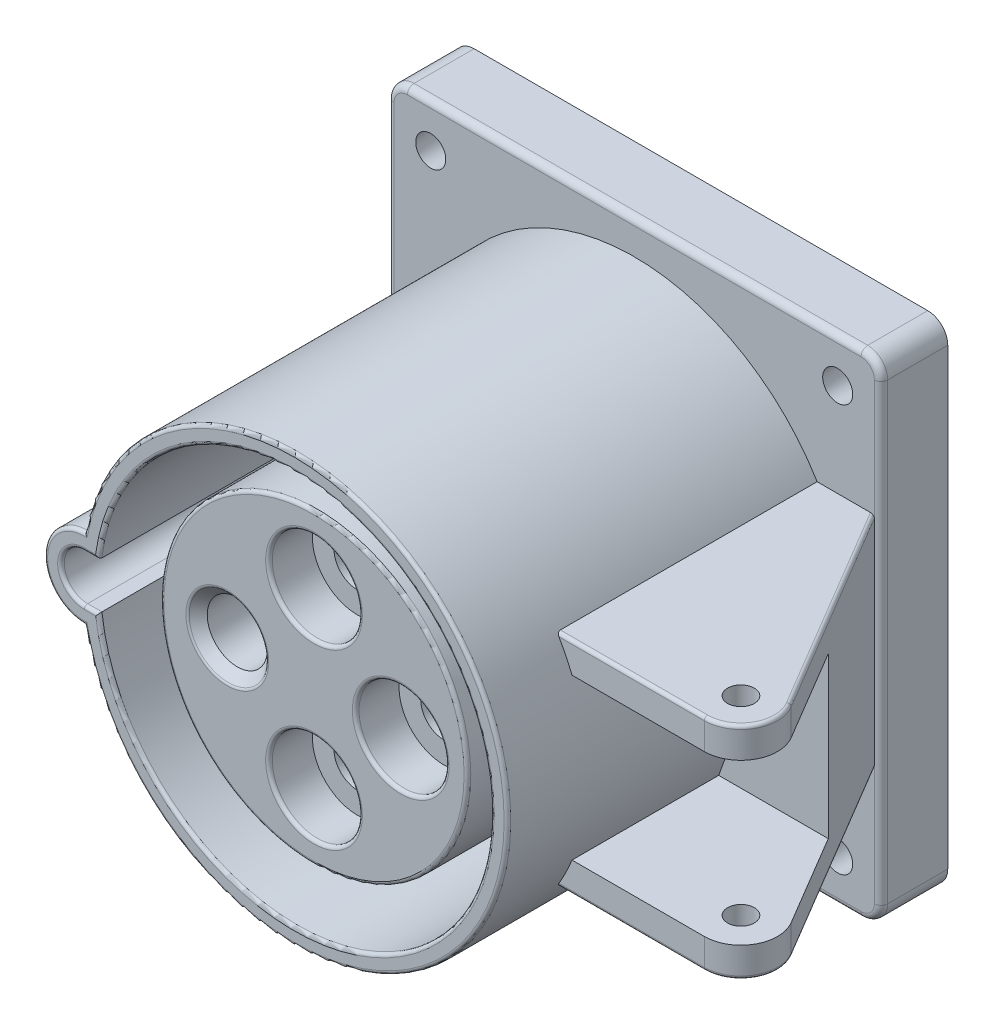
ISO-10303-21;
HEADER;
FILE_DESCRIPTION(('STEP AP214'),'2;1');
FILE_NAME('part.step','',(''),(''),'','','');
FILE_SCHEMA(('AUTOMOTIVE_DESIGN { 1 0 10303 214 1 1 1 1 }'));
ENDSEC;
DATA;
#1=APPLICATION_CONTEXT('core data for automotive mechanical design processes');
#2=APPLICATION_PROTOCOL_DEFINITION('international standard','automotive_design',2000,#1);
#3=PRODUCT_CONTEXT('',#1,'mechanical');
#4=PRODUCT('Part','Part','',(#3));
#5=PRODUCT_RELATED_PRODUCT_CATEGORY('part','',(#4));
#6=PRODUCT_DEFINITION_FORMATION('','',#4);
#7=PRODUCT_DEFINITION_CONTEXT('part definition',#1,'design');
#8=PRODUCT_DEFINITION('design','',#6,#7);
#9=PRODUCT_DEFINITION_SHAPE('','',#8);
#10=(LENGTH_UNIT() NAMED_UNIT(*) SI_UNIT(.MILLI.,.METRE.));
#11=(NAMED_UNIT(*) PLANE_ANGLE_UNIT() SI_UNIT($,.RADIAN.));
#12=(NAMED_UNIT(*) SI_UNIT($,.STERADIAN.) SOLID_ANGLE_UNIT());
#13=UNCERTAINTY_MEASURE_WITH_UNIT(LENGTH_MEASURE(1.E-05),#10,'distance_accuracy_value','');
#14=(GEOMETRIC_REPRESENTATION_CONTEXT(3) GLOBAL_UNCERTAINTY_ASSIGNED_CONTEXT((#13)) GLOBAL_UNIT_ASSIGNED_CONTEXT((#10,
#11,#12)) REPRESENTATION_CONTEXT('',''));
#15=CARTESIAN_POINT('',(0.,0.,0.));
#16=DIRECTION('',(0.,0.,1.));
#17=DIRECTION('',(1.,0.,0.));
#18=AXIS2_PLACEMENT_3D('',#15,#16,#17);
#19=CARTESIAN_POINT('',(49.5,-16.5,43.5));
#20=DIRECTION('',(0.,1.,0.));
#21=DIRECTION('',(0.,0.,1.));
#22=AXIS2_PLACEMENT_3D('',#19,#20,#21);
#23=CYLINDRICAL_SURFACE('',#22,1.99999999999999);
#24=CARTESIAN_POINT('',(49.5,-12.,43.5));
#25=DIRECTION('',(0.,-1.,0.));
#26=DIRECTION('',(0.,0.,-1.));
#27=AXIS2_PLACEMENT_3D('',#24,#25,#26);
#28=CIRCLE('',#27,1.99999999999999);
#29=CARTESIAN_POINT('',(49.5,-12.,41.5));
#30=VERTEX_POINT('',#29);
#31=EDGE_CURVE('E321',#30,#30,#28,.F.);
#32=ORIENTED_EDGE('',*,*,#31,.T.);
#33=EDGE_LOOP('',(#32));
#34=FACE_BOUND('',#33,.T.);
#35=CARTESIAN_POINT('',(49.5,-16.5,43.5));
#36=DIRECTION('',(0.,1.,0.));
#37=DIRECTION('',(0.,0.,1.));
#38=AXIS2_PLACEMENT_3D('',#35,#36,#37);
#39=CIRCLE('',#38,1.99999999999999);
#40=CARTESIAN_POINT('',(49.5,-16.5,45.5));
#41=VERTEX_POINT('',#40);
#42=EDGE_CURVE('E329',#41,#41,#39,.T.);
#43=ORIENTED_EDGE('',*,*,#42,.F.);
#44=EDGE_LOOP('',(#43));
#45=FACE_BOUND('',#44,.T.);
#46=ADVANCED_FACE('F37',(#34,#45),#23,.F.);
#47=CARTESIAN_POINT('',(49.5,-16.5,48.9890222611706));
#48=DIRECTION('',(0.,0.,1.));
#49=DIRECTION('',(1.,0.,0.));
#50=AXIS2_PLACEMENT_3D('',#47,#48,#49);
#51=PLANE('',#50);
#52=CARTESIAN_POINT('',(0.,0.,48.9890222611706));
#53=DIRECTION('',(0.,0.,1.));
#54=DIRECTION('',(1.,0.,0.));
#55=AXIS2_PLACEMENT_3D('',#52,#53,#54);
#56=CIRCLE('',#55,32.);
#57=CARTESIAN_POINT('',(27.712812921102,-16.,48.9890222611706));
#58=VERTEX_POINT('',#57);
#59=CARTESIAN_POINT('',(29.6647939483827,-12.,48.9890222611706));
#60=VERTEX_POINT('',#59);
#61=EDGE_CURVE('E349',#58,#60,#56,.T.);
#62=ORIENTED_EDGE('',*,*,#61,.F.);
#63=DIRECTION('',(1.,0.,0.));
#64=VECTOR('',#63,1.);
#65=CARTESIAN_POINT('',(49.5,-16.,48.9890222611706));
#66=LINE('',#65,#64);
#67=CARTESIAN_POINT('',(49.5,-16.,48.9890222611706));
#68=VERTEX_POINT('',#67);
#69=EDGE_CURVE('E605',#58,#68,#66,.T.);
#70=ORIENTED_EDGE('',*,*,#69,.T.);
#71=DIRECTION('',(0.,1.,0.));
#72=VECTOR('',#71,1.);
#73=CARTESIAN_POINT('',(49.5,-16.5,48.9890222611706));
#74=LINE('',#73,#72);
#75=CARTESIAN_POINT('',(49.5,-12.,48.9890222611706));
#76=VERTEX_POINT('',#75);
#77=EDGE_CURVE('E335',#68,#76,#74,.T.);
#78=ORIENTED_EDGE('',*,*,#77,.T.);
#79=DIRECTION('',(1.,0.,0.));
#80=VECTOR('',#79,1.);
#81=CARTESIAN_POINT('',(49.5,-12.,48.9890222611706));
#82=LINE('',#81,#80);
#83=EDGE_CURVE('E316',#60,#76,#82,.T.);
#84=ORIENTED_EDGE('',*,*,#83,.F.);
#85=EDGE_LOOP('',(#62,#70,#78,#84));
#86=FACE_BOUND('',#85,.T.);
#87=ADVANCED_FACE('F816',(#86),#51,.T.);
#88=CARTESIAN_POINT('',(49.5,-16.5,43.5));
#89=DIRECTION('',(0.,1.,0.));
#90=DIRECTION('',(0.,0.,1.));
#91=AXIS2_PLACEMENT_3D('',#88,#89,#90);
#92=CYLINDRICAL_SURFACE('',#91,5.48902226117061);
#93=ORIENTED_EDGE('',*,*,#77,.F.);
#94=CARTESIAN_POINT('',(49.5,-16.,43.5));
#95=DIRECTION('',(0.,1.,0.));
#96=DIRECTION('',(0.,0.,1.));
#97=AXIS2_PLACEMENT_3D('',#94,#95,#96);
#98=CIRCLE('',#97,5.48902226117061);
#99=CARTESIAN_POINT('',(54.2202317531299,-16.,40.6984330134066));
#100=VERTEX_POINT('',#99);
#101=EDGE_CURVE('E600',#68,#100,#98,.T.);
#102=ORIENTED_EDGE('',*,*,#101,.T.);
#103=DIRECTION('',(0.,1.,0.));
#104=VECTOR('',#103,1.);
#105=CARTESIAN_POINT('',(54.2202317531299,-16.5,40.6984330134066));
#106=LINE('',#105,#104);
#107=CARTESIAN_POINT('',(54.2202317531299,-12.,40.6984330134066));
#108=VERTEX_POINT('',#107);
#109=EDGE_CURVE('E341',#100,#108,#106,.T.);
#110=ORIENTED_EDGE('',*,*,#109,.T.);
#111=CARTESIAN_POINT('',(49.5,-12.,43.5));
#112=DIRECTION('',(0.,-1.,0.));
#113=DIRECTION('',(0.,0.,-1.));
#114=AXIS2_PLACEMENT_3D('',#111,#112,#113);
#115=CIRCLE('',#114,5.48902226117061);
#116=EDGE_CURVE('E646',#76,#108,#115,.F.);
#117=ORIENTED_EDGE('',*,*,#116,.F.);
#118=EDGE_LOOP('',(#93,#102,#110,#117));
#119=FACE_BOUND('',#118,.T.);
#120=ADVANCED_FACE('F825',(#119),#92,.T.);
#121=CARTESIAN_POINT('',(0.,0.,10.));
#122=DIRECTION('',(0.,0.,-1.));
#123=DIRECTION('',(-1.,0.,0.));
#124=AXIS2_PLACEMENT_3D('',#121,#122,#123);
#125=PLANE('',#124);
#126=CARTESIAN_POINT('',(30.5,-30.5,10.));
#127=DIRECTION('',(0.,0.,1.));
#128=DIRECTION('',(1.,0.,0.));
#129=AXIS2_PLACEMENT_3D('',#126,#127,#128);
#130=CIRCLE('',#129,2.25);
#131=CARTESIAN_POINT('',(32.75,-30.5,10.));
#132=VERTEX_POINT('',#131);
#133=EDGE_CURVE('E356',#132,#132,#130,.T.);
#134=ORIENTED_EDGE('',*,*,#133,.F.);
#135=EDGE_LOOP('',(#134));
#136=FACE_BOUND('',#135,.T.);
#137=CARTESIAN_POINT('',(-30.5,-30.5,10.));
#138=DIRECTION('',(0.,0.,1.));
#139=DIRECTION('',(1.,0.,0.));
#140=AXIS2_PLACEMENT_3D('',#137,#138,#139);
#141=CIRCLE('',#140,2.25);
#142=CARTESIAN_POINT('',(-28.25,-30.5,10.));
#143=VERTEX_POINT('',#142);
#144=EDGE_CURVE('E352',#143,#143,#141,.T.);
#145=ORIENTED_EDGE('',*,*,#144,.F.);
#146=EDGE_LOOP('',(#145));
#147=FACE_BOUND('',#146,.T.);
#148=DIRECTION('',(0.,1.,0.));
#149=VECTOR('',#148,1.);
#150=CARTESIAN_POINT('',(36.,0.,10.));
#151=LINE('',#150,#149);
#152=CARTESIAN_POINT('',(36.,-34.,10.));
#153=VERTEX_POINT('',#152);
#154=CARTESIAN_POINT('',(36.,-16.,10.));
#155=VERTEX_POINT('',#154);
#156=EDGE_CURVE('E483',#153,#155,#151,.T.);
#157=ORIENTED_EDGE('',*,*,#156,.T.);
#158=CARTESIAN_POINT('',(35.4185643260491,-16.,10.));
#159=DIRECTION('',(0.,0.,-1.));
#160=DIRECTION('',(1.,0.,0.));
#161=AXIS2_PLACEMENT_3D('',#158,#159,#160);
#162=ELLIPSE('',#161,0.581435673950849,0.5);
#163=CARTESIAN_POINT('',(35.4185643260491,-16.5,10.));
#164=VERTEX_POINT('',#163);
#165=EDGE_CURVE('E624',#155,#164,#162,.T.);
#166=ORIENTED_EDGE('',*,*,#165,.T.);
#167=DIRECTION('',(-1.,0.,0.));
#168=VECTOR('',#167,1.);
#169=CARTESIAN_POINT('',(25.8236447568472,-16.5,10.));
#170=LINE('',#169,#168);
#171=CARTESIAN_POINT('',(27.4180597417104,-16.5,10.));
#172=VERTEX_POINT('',#171);
#173=EDGE_CURVE('E332',#164,#172,#170,.T.);
#174=ORIENTED_EDGE('',*,*,#173,.T.);
#175=CARTESIAN_POINT('',(0.,0.,10.));
#176=DIRECTION('',(0.,0.,-1.));
#177=DIRECTION('',(-1.,0.,0.));
#178=AXIS2_PLACEMENT_3D('',#175,#176,#177);
#179=CIRCLE('',#178,32.);
#180=CARTESIAN_POINT('',(-31.4324674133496,-5.99999935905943,10.));
#181=VERTEX_POINT('',#180);
#182=EDGE_CURVE('E434',#181,#172,#179,.F.);
#183=ORIENTED_EDGE('',*,*,#182,.F.);
#184=CARTESIAN_POINT('',(-31.4296940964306,0.,10.));
#185=DIRECTION('',(0.,0.,-1.));
#186=DIRECTION('',(-1.,0.,0.));
#187=AXIS2_PLACEMENT_3D('',#184,#185,#186);
#188=CIRCLE('',#187,6.);
#189=CARTESIAN_POINT('',(-36.,-3.88745468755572,10.));
#190=VERTEX_POINT('',#189);
#191=EDGE_CURVE('E410',#190,#181,#188,.F.);
#192=ORIENTED_EDGE('',*,*,#191,.F.);
#193=DIRECTION('',(0.,-1.,0.));
#194=VECTOR('',#193,1.);
#195=CARTESIAN_POINT('',(-36.,0.,10.));
#196=LINE('',#195,#194);
#197=CARTESIAN_POINT('',(-36.,-34.,10.));
#198=VERTEX_POINT('',#197);
#199=EDGE_CURVE('E492',#190,#198,#196,.T.);
#200=ORIENTED_EDGE('',*,*,#199,.T.);
#201=CARTESIAN_POINT('',(-34.,-34.,10.));
#202=DIRECTION('',(0.,0.,-1.));
#203=DIRECTION('',(-1.,0.,0.));
#204=AXIS2_PLACEMENT_3D('',#201,#202,#203);
#205=CIRCLE('',#204,2.);
#206=CARTESIAN_POINT('',(-34.,-36.,10.));
#207=VERTEX_POINT('',#206);
#208=EDGE_CURVE('E490',#198,#207,#205,.F.);
#209=ORIENTED_EDGE('',*,*,#208,.T.);
#210=DIRECTION('',(1.,0.,0.));
#211=VECTOR('',#210,1.);
#212=CARTESIAN_POINT('',(0.,-36.,10.));
#213=LINE('',#212,#211);
#214=CARTESIAN_POINT('',(34.,-36.,10.));
#215=VERTEX_POINT('',#214);
#216=EDGE_CURVE('E488',#207,#215,#213,.T.);
#217=ORIENTED_EDGE('',*,*,#216,.T.);
#218=CARTESIAN_POINT('',(34.,-34.,10.));
#219=DIRECTION('',(0.,0.,-1.));
#220=DIRECTION('',(-1.,0.,0.));
#221=AXIS2_PLACEMENT_3D('',#218,#219,#220);
#222=CIRCLE('',#221,2.);
#223=EDGE_CURVE('E486',#215,#153,#222,.F.);
#224=ORIENTED_EDGE('',*,*,#223,.T.);
#225=EDGE_LOOP('',(#157,#166,#174,#183,#192,#200,#209,#217,#224));
#226=FACE_BOUND('',#225,.T.);
#227=ADVANCED_FACE('F568',(#136,#147,#226),#125,.F.);
#228=CARTESIAN_POINT('',(0.,0.,61.));
#229=DIRECTION('',(0.,0.,-1.));
#230=DIRECTION('',(-1.,0.,0.));
#231=AXIS2_PLACEMENT_3D('',#228,#229,#230);
#232=CYLINDRICAL_SURFACE('',#231,32.);
#233=CARTESIAN_POINT('',(0.,0.,60.5));
#234=DIRECTION('',(0.,0.,1.));
#235=DIRECTION('',(1.,0.,0.));
#236=AXIS2_PLACEMENT_3D('',#233,#234,#235);
#237=CIRCLE('',#236,32.);
#238=CARTESIAN_POINT('',(-31.4324674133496,5.99999935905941,60.5));
#239=VERTEX_POINT('',#238);
#240=CARTESIAN_POINT('',(-31.4324674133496,-5.99999935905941,60.5));
#241=VERTEX_POINT('',#240);
#242=EDGE_CURVE('E682',#239,#241,#237,.F.);
#243=ORIENTED_EDGE('',*,*,#242,.T.);
#244=DIRECTION('',(0.,0.,1.));
#245=VECTOR('',#244,1.);
#246=CARTESIAN_POINT('',(-31.4324674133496,-5.99999935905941,35.5));
#247=LINE('',#246,#245);
#248=EDGE_CURVE('E437',#241,#181,#247,.F.);
#249=ORIENTED_EDGE('',*,*,#248,.T.);
#250=ORIENTED_EDGE('',*,*,#182,.T.);
#251=DIRECTION('',(0.,0.,-1.));
#252=VECTOR('',#251,1.);
#253=CARTESIAN_POINT('',(27.4180597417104,-16.5,61.));
#254=LINE('',#253,#252);
#255=CARTESIAN_POINT('',(27.4180597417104,-16.5,48.4890222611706));
#256=VERTEX_POINT('',#255);
#257=EDGE_CURVE('E345',#256,#172,#254,.T.);
#258=ORIENTED_EDGE('',*,*,#257,.F.);
#259=CARTESIAN_POINT('',(27.4180597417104,-16.5,48.4890222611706));
#260=CARTESIAN_POINT('',(27.4180385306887,-16.5000335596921,48.5143159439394));
#261=CARTESIAN_POINT('',(27.4192133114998,-16.4980831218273,48.5395785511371));
#262=CARTESIAN_POINT('',(27.4237822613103,-16.4904881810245,48.5892203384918));
#263=CARTESIAN_POINT('',(27.427166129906,-16.4848608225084,48.6136030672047));
#264=CARTESIAN_POINT('',(27.4359791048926,-16.4701887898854,48.6608874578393));
#265=CARTESIAN_POINT('',(27.4414061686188,-16.4611475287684,48.683790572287));
#266=CARTESIAN_POINT('',(27.4540463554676,-16.440057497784,48.7276469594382));
#267=CARTESIAN_POINT('',(27.4612611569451,-16.4280059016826,48.7485983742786));
#268=CARTESIAN_POINT('',(27.4776347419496,-16.4006053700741,48.7892721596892));
#269=CARTESIAN_POINT('',(27.486879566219,-16.3851099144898,48.808860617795));
#270=CARTESIAN_POINT('',(27.5067053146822,-16.3518053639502,48.8451690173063));
#271=CARTESIAN_POINT('',(27.5172865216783,-16.3339957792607,48.861888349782));
#272=CARTESIAN_POINT('',(27.5409935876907,-16.2939952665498,48.8943836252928));
#273=CARTESIAN_POINT('',(27.5542697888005,-16.271537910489,48.9097216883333));
#274=CARTESIAN_POINT('',(27.5817705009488,-16.224878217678,48.9364075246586));
#275=CARTESIAN_POINT('',(27.5959960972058,-16.2006738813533,48.9477506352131));
#276=CARTESIAN_POINT('',(27.6271081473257,-16.1475682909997,48.9677059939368));
#277=CARTESIAN_POINT('',(27.6440855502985,-16.1184882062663,48.9757015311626));
#278=CARTESIAN_POINT('',(27.6783341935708,-16.0596079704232,48.9863560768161));
#279=CARTESIAN_POINT('',(27.6956048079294,-16.02980930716,48.9890252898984));
#280=CARTESIAN_POINT('',(27.712812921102,-16.,48.9890222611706));
#281=B_SPLINE_CURVE_WITH_KNOTS('',3,(#259,#260,#261,#262,#263,#264,#265,#266,#267,#268,#269,
#270,#271,#272,#273,#274,#275,#276,#277,#278,#279,#280),.UNSPECIFIED.,.F.,.F.,(4,2,2,2,2,2,2,2,
2,2,4),(0.,0.0757298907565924,0.151109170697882,0.226413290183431,0.30178837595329,
0.381371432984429,0.460971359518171,0.551401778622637,0.641937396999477,0.745332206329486,
0.848528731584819),.UNSPECIFIED.);
#282=EDGE_CURVE('E11',#256,#58,#281,.T.);
#283=ORIENTED_EDGE('',*,*,#282,.T.);
#284=ORIENTED_EDGE('',*,*,#61,.T.);
#285=DIRECTION('',(0.,0.,1.));
#286=VECTOR('',#285,1.);
#287=CARTESIAN_POINT('',(29.6647939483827,-12.,27.));
#288=LINE('',#287,#286);
#289=CARTESIAN_POINT('',(29.6647939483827,-12.,27.));
#290=VERTEX_POINT('',#289);
#291=EDGE_CURVE('E301',#290,#60,#288,.T.);
#292=ORIENTED_EDGE('',*,*,#291,.F.);
#293=CARTESIAN_POINT('',(0.,0.,27.));
#294=DIRECTION('',(0.,0.,-1.));
#295=DIRECTION('',(1.,0.,0.));
#296=AXIS2_PLACEMENT_3D('',#293,#294,#295);
#297=CIRCLE('',#296,32.);
#298=CARTESIAN_POINT('',(29.6647939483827,12.,27.));
#299=VERTEX_POINT('',#298);
#300=EDGE_CURVE('E285',#299,#290,#297,.T.);
#301=ORIENTED_EDGE('',*,*,#300,.F.);
#302=DIRECTION('',(0.,0.,1.));
#303=VECTOR('',#302,1.);
#304=CARTESIAN_POINT('',(29.6647939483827,12.,27.));
#305=LINE('',#304,#303);
#306=CARTESIAN_POINT('',(29.6647939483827,12.,48.9890222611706));
#307=VERTEX_POINT('',#306);
#308=EDGE_CURVE('E293',#299,#307,#305,.T.);
#309=ORIENTED_EDGE('',*,*,#308,.T.);
#310=CARTESIAN_POINT('',(27.712812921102,16.,48.9890222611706));
#311=VERTEX_POINT('',#310);
#312=EDGE_CURVE('E348',#307,#311,#56,.T.);
#313=ORIENTED_EDGE('',*,*,#312,.T.);
#314=CARTESIAN_POINT('',(27.712812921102,16.,48.9890222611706));
#315=CARTESIAN_POINT('',(27.6915355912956,16.0368628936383,48.9890331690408));
#316=CARTESIAN_POINT('',(27.6701453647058,16.0737328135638,48.9849441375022));
#317=CARTESIAN_POINT('',(27.6278952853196,16.1462407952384,48.9686062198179));
#318=CARTESIAN_POINT('',(27.6070394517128,16.1818699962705,48.9563078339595));
#319=CARTESIAN_POINT('',(27.5696172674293,16.2455347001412,48.9258115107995));
#320=CARTESIAN_POINT('',(27.5528527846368,16.2739447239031,48.9086399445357));
#321=CARTESIAN_POINT('',(27.5212327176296,16.3273605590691,48.8684239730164));
#322=CARTESIAN_POINT('',(27.5063702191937,16.3523787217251,48.8454018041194));
#323=CARTESIAN_POINT('',(27.482713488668,16.3920973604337,48.8003466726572));
#324=CARTESIAN_POINT('',(27.4733318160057,16.407812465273,48.7795108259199));
#325=CARTESIAN_POINT('',(27.4564384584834,16.4360657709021,48.7350684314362));
#326=CARTESIAN_POINT('',(27.4489272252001,16.4486032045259,48.7114612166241));
#327=CARTESIAN_POINT('',(27.4361204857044,16.469955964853,48.6618668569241));
#328=CARTESIAN_POINT('',(27.4308388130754,16.478748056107,48.6358660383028));
#329=CARTESIAN_POINT('',(27.4228970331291,16.4919611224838,48.5824360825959));
#330=CARTESIAN_POINT('',(27.4202303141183,16.4963931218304,48.5550107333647));
#331=CARTESIAN_POINT('',(27.4183534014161,16.4995119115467,48.5146175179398));
#332=CARTESIAN_POINT('',(27.4180552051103,16.5000072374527,48.5018162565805));
#333=CARTESIAN_POINT('',(27.4180597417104,16.5,48.4890222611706));
#334=B_SPLINE_CURVE_WITH_KNOTS('',3,(#314,#315,#316,#317,#318,#319,#320,#321,#322,#323,#324,
#325,#326,#327,#328,#329,#330,#331,#332,#333),.UNSPECIFIED.,.F.,.F.,(4,2,2,2,2,2,2,2,2,4),(0.,
0.127607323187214,0.255991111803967,0.366962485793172,0.47751823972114,0.560376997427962,
0.643255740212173,0.726641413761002,0.809815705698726,0.848205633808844),.UNSPECIFIED.);
#335=CARTESIAN_POINT('',(27.4180597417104,16.5,48.4890222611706));
#336=VERTEX_POINT('',#335);
#337=EDGE_CURVE('E48',#311,#336,#334,.T.);
#338=ORIENTED_EDGE('',*,*,#337,.T.);
#339=DIRECTION('',(0.,0.,-1.));
#340=VECTOR('',#339,1.);
#341=CARTESIAN_POINT('',(27.4180597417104,16.5,61.));
#342=LINE('',#341,#340);
#343=CARTESIAN_POINT('',(27.4180597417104,16.5,10.));
#344=VERTEX_POINT('',#343);
#345=EDGE_CURVE('E337',#336,#344,#342,.T.);
#346=ORIENTED_EDGE('',*,*,#345,.T.);
#347=CARTESIAN_POINT('',(-31.4324674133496,5.99999935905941,10.));
#348=VERTEX_POINT('',#347);
#349=EDGE_CURVE('E433',#344,#348,#179,.F.);
#350=ORIENTED_EDGE('',*,*,#349,.T.);
#351=DIRECTION('',(0.,0.,1.));
#352=VECTOR('',#351,1.);
#353=CARTESIAN_POINT('',(-31.4324674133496,5.99999935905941,35.5));
#354=LINE('',#353,#352);
#355=EDGE_CURVE('E439',#348,#239,#354,.T.);
#356=ORIENTED_EDGE('',*,*,#355,.T.);
#357=EDGE_LOOP('',(#243,#249,#250,#258,#283,#284,#292,#301,#309,#313,#338,#346,#350,#356));
#358=FACE_BOUND('',#357,.T.);
#359=ADVANCED_FACE('F303',(#358),#232,.T.);
#360=CARTESIAN_POINT('',(13.,0.,-16.));
#361=DIRECTION('',(0.,0.,1.));
#362=DIRECTION('',(1.,0.,0.));
#363=AXIS2_PLACEMENT_3D('',#360,#361,#362);
#364=CYLINDRICAL_SURFACE('',#363,3.5);
#365=CARTESIAN_POINT('',(13.,0.,9.));
#366=DIRECTION('',(0.,0.,-1.));
#367=DIRECTION('',(-1.,0.,0.));
#368=AXIS2_PLACEMENT_3D('',#365,#366,#367);
#369=CIRCLE('',#368,3.5);
#370=CARTESIAN_POINT('',(9.5,0.,9.));
#371=VERTEX_POINT('',#370);
#372=EDGE_CURVE('E389',#371,#371,#369,.F.);
#373=ORIENTED_EDGE('',*,*,#372,.F.);
#374=EDGE_LOOP('',(#373));
#375=FACE_BOUND('',#374,.T.);
#376=CARTESIAN_POINT('',(13.,0.,51.5));
#377=DIRECTION('',(0.,0.,1.));
#378=DIRECTION('',(1.,0.,0.));
#379=AXIS2_PLACEMENT_3D('',#376,#377,#378);
#380=CIRCLE('',#379,3.5);
#381=CARTESIAN_POINT('',(16.5,0.,51.5));
#382=VERTEX_POINT('',#381);
#383=EDGE_CURVE('E1454',#382,#382,#380,.F.);
#384=ORIENTED_EDGE('',*,*,#383,.F.);
#385=EDGE_LOOP('',(#384));
#386=FACE_BOUND('',#385,.T.);
#387=ADVANCED_FACE('F567',(#375,#386),#364,.F.);
#388=CARTESIAN_POINT('',(0.,-13.,-16.));
#389=DIRECTION('',(0.,0.,1.));
#390=DIRECTION('',(1.,0.,0.));
#391=AXIS2_PLACEMENT_3D('',#388,#389,#390);
#392=CYLINDRICAL_SURFACE('',#391,3.5);
#393=CARTESIAN_POINT('',(0.,-13.,9.));
#394=DIRECTION('',(0.,0.,-1.));
#395=DIRECTION('',(-1.,0.,0.));
#396=AXIS2_PLACEMENT_3D('',#393,#394,#395);
#397=CIRCLE('',#396,3.5);
#398=CARTESIAN_POINT('',(-3.5,-13.,9.));
#399=VERTEX_POINT('',#398);
#400=EDGE_CURVE('E386',#399,#399,#397,.F.);
#401=ORIENTED_EDGE('',*,*,#400,.F.);
#402=EDGE_LOOP('',(#401));
#403=FACE_BOUND('',#402,.T.);
#404=CARTESIAN_POINT('',(0.,-13.,51.5));
#405=DIRECTION('',(0.,0.,1.));
#406=DIRECTION('',(1.,0.,0.));
#407=AXIS2_PLACEMENT_3D('',#404,#405,#406);
#408=CIRCLE('',#407,3.5);
#409=CARTESIAN_POINT('',(3.5,-13.,51.5));
#410=VERTEX_POINT('',#409);
#411=EDGE_CURVE('E1457',#410,#410,#408,.F.);
#412=ORIENTED_EDGE('',*,*,#411,.F.);
#413=EDGE_LOOP('',(#412));
#414=FACE_BOUND('',#413,.T.);
#415=ADVANCED_FACE('F1344',(#403,#414),#392,.F.);
#416=CARTESIAN_POINT('',(0.,13.,-16.));
#417=DIRECTION('',(0.,0.,1.));
#418=DIRECTION('',(1.,0.,0.));
#419=AXIS2_PLACEMENT_3D('',#416,#417,#418);
#420=CYLINDRICAL_SURFACE('',#419,3.5);
#421=CARTESIAN_POINT('',(0.,13.,9.));
#422=DIRECTION('',(0.,0.,-1.));
#423=DIRECTION('',(-1.,0.,0.));
#424=AXIS2_PLACEMENT_3D('',#421,#422,#423);
#425=CIRCLE('',#424,3.5);
#426=CARTESIAN_POINT('',(-3.5,13.,9.));
#427=VERTEX_POINT('',#426);
#428=EDGE_CURVE('E383',#427,#427,#425,.F.);
#429=ORIENTED_EDGE('',*,*,#428,.F.);
#430=EDGE_LOOP('',(#429));
#431=FACE_BOUND('',#430,.T.);
#432=CARTESIAN_POINT('',(0.,13.,51.5));
#433=DIRECTION('',(0.,0.,1.));
#434=DIRECTION('',(1.,0.,0.));
#435=AXIS2_PLACEMENT_3D('',#432,#433,#434);
#436=CIRCLE('',#435,3.5);
#437=CARTESIAN_POINT('',(3.5,13.,51.5));
#438=VERTEX_POINT('',#437);
#439=EDGE_CURVE('E374',#438,#438,#436,.F.);
#440=ORIENTED_EDGE('',*,*,#439,.F.);
#441=EDGE_LOOP('',(#440));
#442=FACE_BOUND('',#441,.T.);
#443=ADVANCED_FACE('F1337',(#431,#442),#420,.F.);
#444=CARTESIAN_POINT('',(-13.,0.,-16.));
#445=DIRECTION('',(0.,0.,1.));
#446=DIRECTION('',(1.,0.,0.));
#447=AXIS2_PLACEMENT_3D('',#444,#445,#446);
#448=CYLINDRICAL_SURFACE('',#447,4.5);
#449=CARTESIAN_POINT('',(-13.,0.,56.5));
#450=DIRECTION('',(0.,0.,1.));
#451=DIRECTION('',(1.,0.,0.));
#452=AXIS2_PLACEMENT_3D('',#449,#450,#451);
#453=CIRCLE('',#452,4.5);
#454=CARTESIAN_POINT('',(-8.5,0.,56.5));
#455=VERTEX_POINT('',#454);
#456=EDGE_CURVE('E1464',#455,#455,#453,.T.);
#457=ORIENTED_EDGE('',*,*,#456,.T.);
#458=EDGE_LOOP('',(#457));
#459=FACE_BOUND('',#458,.T.);
#460=CARTESIAN_POINT('',(-13.,0.,9.));
#461=DIRECTION('',(0.,0.,-1.));
#462=DIRECTION('',(-1.,0.,0.));
#463=AXIS2_PLACEMENT_3D('',#460,#461,#462);
#464=CIRCLE('',#463,4.5);
#465=CARTESIAN_POINT('',(-17.5,0.,9.));
#466=VERTEX_POINT('',#465);
#467=EDGE_CURVE('E378',#466,#466,#464,.F.);
#468=ORIENTED_EDGE('',*,*,#467,.F.);
#469=EDGE_LOOP('',(#468));
#470=FACE_BOUND('',#469,.T.);
#471=ADVANCED_FACE('F1330',(#459,#470),#448,.F.);
#472=CARTESIAN_POINT('',(37.,-37.,10.));
#473=DIRECTION('',(-1.,0.,0.));
#474=DIRECTION('',(0.,0.,1.));
#475=AXIS2_PLACEMENT_3D('',#472,#473,#474);
#476=PLANE('',#475);
#477=DIRECTION('',(0.,0.,-1.));
#478=VECTOR('',#477,1.);
#479=CARTESIAN_POINT('',(37.,34.,10.));
#480=LINE('',#479,#478);
#481=CARTESIAN_POINT('',(37.,34.,0.));
#482=VERTEX_POINT('',#481);
#483=CARTESIAN_POINT('',(37.,34.,9.));
#484=VERTEX_POINT('',#483);
#485=EDGE_CURVE('E457',#482,#484,#480,.F.);
#486=ORIENTED_EDGE('',*,*,#485,.T.);
#487=DIRECTION('',(0.,1.,0.));
#488=VECTOR('',#487,1.);
#489=CARTESIAN_POINT('',(37.,-37.,9.));
#490=LINE('',#489,#488);
#491=CARTESIAN_POINT('',(37.,-34.,9.));
#492=VERTEX_POINT('',#491);
#493=EDGE_CURVE('E511',#484,#492,#490,.F.);
#494=ORIENTED_EDGE('',*,*,#493,.T.);
#495=DIRECTION('',(0.,0.,-1.));
#496=VECTOR('',#495,1.);
#497=CARTESIAN_POINT('',(37.,-34.,10.));
#498=LINE('',#497,#496);
#499=CARTESIAN_POINT('',(37.,-34.,0.));
#500=VERTEX_POINT('',#499);
#501=EDGE_CURVE('E455',#492,#500,#498,.T.);
#502=ORIENTED_EDGE('',*,*,#501,.T.);
#503=DIRECTION('',(0.,1.,0.));
#504=VECTOR('',#503,1.);
#505=CARTESIAN_POINT('',(37.,-37.,0.));
#506=LINE('',#505,#504);
#507=EDGE_CURVE('E421',#500,#482,#506,.T.);
#508=ORIENTED_EDGE('',*,*,#507,.T.);
#509=EDGE_LOOP('',(#486,#494,#502,#508));
#510=FACE_BOUND('',#509,.T.);
#511=ADVANCED_FACE('F1323',(#510),#476,.F.);
#512=CARTESIAN_POINT('',(-37.,37.,10.));
#513=DIRECTION('',(0.,-1.,0.));
#514=DIRECTION('',(0.,0.,-1.));
#515=AXIS2_PLACEMENT_3D('',#512,#513,#514);
#516=PLANE('',#515);
#517=DIRECTION('',(0.,0.,-1.));
#518=VECTOR('',#517,1.);
#519=CARTESIAN_POINT('',(-34.,37.,10.));
#520=LINE('',#519,#518);
#521=CARTESIAN_POINT('',(-34.,37.,0.));
#522=VERTEX_POINT('',#521);
#523=CARTESIAN_POINT('',(-34.,37.,9.));
#524=VERTEX_POINT('',#523);
#525=EDGE_CURVE('E442',#522,#524,#520,.F.);
#526=ORIENTED_EDGE('',*,*,#525,.T.);
#527=DIRECTION('',(-1.,0.,0.));
#528=VECTOR('',#527,1.);
#529=CARTESIAN_POINT('',(-37.,37.,9.));
#530=LINE('',#529,#528);
#531=CARTESIAN_POINT('',(34.,37.,9.));
#532=VERTEX_POINT('',#531);
#533=EDGE_CURVE('E517',#524,#532,#530,.F.);
#534=ORIENTED_EDGE('',*,*,#533,.T.);
#535=DIRECTION('',(0.,0.,-1.));
#536=VECTOR('',#535,1.);
#537=CARTESIAN_POINT('',(34.,37.,10.));
#538=LINE('',#537,#536);
#539=CARTESIAN_POINT('',(34.,37.,0.));
#540=VERTEX_POINT('',#539);
#541=EDGE_CURVE('E445',#532,#540,#538,.T.);
#542=ORIENTED_EDGE('',*,*,#541,.T.);
#543=DIRECTION('',(-1.,0.,0.));
#544=VECTOR('',#543,1.);
#545=CARTESIAN_POINT('',(-37.,37.,0.));
#546=LINE('',#545,#544);
#547=EDGE_CURVE('E424',#540,#522,#546,.T.);
#548=ORIENTED_EDGE('',*,*,#547,.T.);
#549=EDGE_LOOP('',(#526,#534,#542,#548));
#550=FACE_BOUND('',#549,.T.);
#551=ADVANCED_FACE('F1315',(#550),#516,.F.);
#552=CARTESIAN_POINT('',(-37.,-37.,10.));
#553=DIRECTION('',(1.,0.,0.));
#554=DIRECTION('',(0.,0.,-1.));
#555=AXIS2_PLACEMENT_3D('',#552,#553,#554);
#556=PLANE('',#555);
#557=DIRECTION('',(0.,0.,-1.));
#558=VECTOR('',#557,1.);
#559=CARTESIAN_POINT('',(-37.,-34.,10.));
#560=LINE('',#559,#558);
#561=CARTESIAN_POINT('',(-37.,-34.,0.));
#562=VERTEX_POINT('',#561);
#563=CARTESIAN_POINT('',(-37.,-34.,9.));
#564=VERTEX_POINT('',#563);
#565=EDGE_CURVE('E467',#562,#564,#560,.F.);
#566=ORIENTED_EDGE('',*,*,#565,.T.);
#567=DIRECTION('',(0.,-1.,0.));
#568=VECTOR('',#567,1.);
#569=CARTESIAN_POINT('',(-37.,-37.,9.));
#570=LINE('',#569,#568);
#571=CARTESIAN_POINT('',(-37.,-2.22972916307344,9.));
#572=VERTEX_POINT('',#571);
#573=EDGE_CURVE('E502',#564,#572,#570,.F.);
#574=ORIENTED_EDGE('',*,*,#573,.T.);
#575=DIRECTION('',(0.,0.,1.));
#576=VECTOR('',#575,1.);
#577=CARTESIAN_POINT('',(-37.,-2.22972916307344,9.));
#578=LINE('',#577,#576);
#579=CARTESIAN_POINT('',(-37.,-2.22972916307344,10.));
#580=VERTEX_POINT('',#579);
#581=EDGE_CURVE('E500',#572,#580,#578,.T.);
#582=ORIENTED_EDGE('',*,*,#581,.T.);
#583=DIRECTION('',(0.,1.,0.));
#584=VECTOR('',#583,1.);
#585=CARTESIAN_POINT('',(-37.,-37.,10.));
#586=LINE('',#585,#584);
#587=CARTESIAN_POINT('',(-37.,2.22972916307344,10.));
#588=VERTEX_POINT('',#587);
#589=EDGE_CURVE('E416',#580,#588,#586,.T.);
#590=ORIENTED_EDGE('',*,*,#589,.T.);
#591=DIRECTION('',(0.,0.,1.));
#592=VECTOR('',#591,1.);
#593=CARTESIAN_POINT('',(-37.,2.22972916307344,10.));
#594=LINE('',#593,#592);
#595=CARTESIAN_POINT('',(-37.,2.22972916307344,9.));
#596=VERTEX_POINT('',#595);
#597=EDGE_CURVE('E497',#588,#596,#594,.F.);
#598=ORIENTED_EDGE('',*,*,#597,.T.);
#599=DIRECTION('',(0.,-1.,0.));
#600=VECTOR('',#599,1.);
#601=CARTESIAN_POINT('',(-37.,-37.,9.));
#602=LINE('',#601,#600);
#603=CARTESIAN_POINT('',(-37.,34.,9.));
#604=VERTEX_POINT('',#603);
#605=EDGE_CURVE('E495',#596,#604,#602,.F.);
#606=ORIENTED_EDGE('',*,*,#605,.T.);
#607=DIRECTION('',(0.,0.,-1.));
#608=VECTOR('',#607,1.);
#609=CARTESIAN_POINT('',(-37.,34.,10.));
#610=LINE('',#609,#608);
#611=CARTESIAN_POINT('',(-37.,34.,0.));
#612=VERTEX_POINT('',#611);
#613=EDGE_CURVE('E465',#604,#612,#610,.T.);
#614=ORIENTED_EDGE('',*,*,#613,.T.);
#615=DIRECTION('',(0.,-1.,0.));
#616=VECTOR('',#615,1.);
#617=CARTESIAN_POINT('',(-37.,-37.,0.));
#618=LINE('',#617,#616);
#619=EDGE_CURVE('E427',#612,#562,#618,.T.);
#620=ORIENTED_EDGE('',*,*,#619,.T.);
#621=EDGE_LOOP('',(#566,#574,#582,#590,#598,#606,#614,#620));
#622=FACE_BOUND('',#621,.T.);
#623=ADVANCED_FACE('F1308',(#622),#556,.F.);
#624=CARTESIAN_POINT('',(-37.,-37.,10.));
#625=DIRECTION('',(0.,1.,0.));
#626=DIRECTION('',(0.,0.,1.));
#627=AXIS2_PLACEMENT_3D('',#624,#625,#626);
#628=PLANE('',#627);
#629=DIRECTION('',(0.,0.,-1.));
#630=VECTOR('',#629,1.);
#631=CARTESIAN_POINT('',(34.,-37.,10.));
#632=LINE('',#631,#630);
#633=CARTESIAN_POINT('',(34.,-37.,0.));
#634=VERTEX_POINT('',#633);
#635=CARTESIAN_POINT('',(34.,-37.,9.));
#636=VERTEX_POINT('',#635);
#637=EDGE_CURVE('E462',#634,#636,#632,.F.);
#638=ORIENTED_EDGE('',*,*,#637,.T.);
#639=DIRECTION('',(1.,0.,0.));
#640=VECTOR('',#639,1.);
#641=CARTESIAN_POINT('',(-37.,-37.,9.));
#642=LINE('',#641,#640);
#643=CARTESIAN_POINT('',(-34.,-37.,9.));
#644=VERTEX_POINT('',#643);
#645=EDGE_CURVE('E507',#636,#644,#642,.F.);
#646=ORIENTED_EDGE('',*,*,#645,.T.);
#647=DIRECTION('',(0.,0.,-1.));
#648=VECTOR('',#647,1.);
#649=CARTESIAN_POINT('',(-34.,-37.,10.));
#650=LINE('',#649,#648);
#651=CARTESIAN_POINT('',(-34.,-37.,0.));
#652=VERTEX_POINT('',#651);
#653=EDGE_CURVE('E460',#644,#652,#650,.T.);
#654=ORIENTED_EDGE('',*,*,#653,.T.);
#655=DIRECTION('',(1.,0.,0.));
#656=VECTOR('',#655,1.);
#657=CARTESIAN_POINT('',(-37.,-37.,0.));
#658=LINE('',#657,#656);
#659=EDGE_CURVE('E430',#652,#634,#658,.T.);
#660=ORIENTED_EDGE('',*,*,#659,.T.);
#661=EDGE_LOOP('',(#638,#646,#654,#660));
#662=FACE_BOUND('',#661,.T.);
#663=ADVANCED_FACE('F1300',(#662),#628,.F.);
#664=CARTESIAN_POINT('',(30.5,30.5,10.));
#665=DIRECTION('',(0.,0.,1.));
#666=DIRECTION('',(1.,0.,0.));
#667=AXIS2_PLACEMENT_3D('',#664,#665,#666);
#668=CIRCLE('',#667,2.25);
#669=CARTESIAN_POINT('',(32.75,30.5,10.));
#670=VERTEX_POINT('',#669);
#671=EDGE_CURVE('E351',#670,#670,#668,.T.);
#672=ORIENTED_EDGE('',*,*,#671,.F.);
#673=EDGE_LOOP('',(#672));
#674=FACE_BOUND('',#673,.T.);
#675=CARTESIAN_POINT('',(-30.5,30.5,10.));
#676=DIRECTION('',(0.,0.,1.));
#677=DIRECTION('',(1.,0.,0.));
#678=AXIS2_PLACEMENT_3D('',#675,#676,#677);
#679=CIRCLE('',#678,2.25);
#680=CARTESIAN_POINT('',(-28.25,30.5,10.));
#681=VERTEX_POINT('',#680);
#682=EDGE_CURVE('E355',#681,#681,#679,.T.);
#683=ORIENTED_EDGE('',*,*,#682,.F.);
#684=EDGE_LOOP('',(#683));
#685=FACE_BOUND('',#684,.T.);
#686=ORIENTED_EDGE('',*,*,#349,.F.);
#687=DIRECTION('',(-1.,0.,0.));
#688=VECTOR('',#687,1.);
#689=CARTESIAN_POINT('',(25.8236447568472,16.5,10.));
#690=LINE('',#689,#688);
#691=CARTESIAN_POINT('',(35.4185643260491,16.5,10.));
#692=VERTEX_POINT('',#691);
#693=EDGE_CURVE('E327',#692,#344,#690,.T.);
#694=ORIENTED_EDGE('',*,*,#693,.F.);
#695=CARTESIAN_POINT('',(35.4185643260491,16.,10.));
#696=DIRECTION('',(0.,0.,-1.));
#697=DIRECTION('',(-1.,0.,0.));
#698=AXIS2_PLACEMENT_3D('',#695,#696,#697);
#699=ELLIPSE('',#698,0.581435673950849,0.5);
#700=CARTESIAN_POINT('',(36.,16.,10.));
#701=VERTEX_POINT('',#700);
#702=EDGE_CURVE('E622',#692,#701,#699,.T.);
#703=ORIENTED_EDGE('',*,*,#702,.T.);
#704=CARTESIAN_POINT('',(36.,34.,10.));
#705=VERTEX_POINT('',#704);
#706=EDGE_CURVE('E56',#701,#705,#151,.T.);
#707=ORIENTED_EDGE('',*,*,#706,.T.);
#708=CARTESIAN_POINT('',(34.,34.,10.));
#709=DIRECTION('',(0.,0.,-1.));
#710=DIRECTION('',(-1.,0.,0.));
#711=AXIS2_PLACEMENT_3D('',#708,#709,#710);
#712=CIRCLE('',#711,2.);
#713=CARTESIAN_POINT('',(34.,36.,10.));
#714=VERTEX_POINT('',#713);
#715=EDGE_CURVE('E481',#705,#714,#712,.F.);
#716=ORIENTED_EDGE('',*,*,#715,.T.);
#717=DIRECTION('',(-1.,0.,0.));
#718=VECTOR('',#717,1.);
#719=CARTESIAN_POINT('',(0.,36.,10.));
#720=LINE('',#719,#718);
#721=CARTESIAN_POINT('',(-34.,36.,10.));
#722=VERTEX_POINT('',#721);
#723=EDGE_CURVE('E473',#714,#722,#720,.T.);
#724=ORIENTED_EDGE('',*,*,#723,.T.);
#725=CARTESIAN_POINT('',(-34.,34.,10.));
#726=DIRECTION('',(0.,0.,-1.));
#727=DIRECTION('',(-1.,0.,0.));
#728=AXIS2_PLACEMENT_3D('',#725,#726,#727);
#729=CIRCLE('',#728,2.);
#730=CARTESIAN_POINT('',(-36.,34.,10.));
#731=VERTEX_POINT('',#730);
#732=EDGE_CURVE('E477',#722,#731,#729,.F.);
#733=ORIENTED_EDGE('',*,*,#732,.T.);
#734=DIRECTION('',(0.,-1.,0.));
#735=VECTOR('',#734,1.);
#736=CARTESIAN_POINT('',(-36.,0.,10.));
#737=LINE('',#736,#735);
#738=CARTESIAN_POINT('',(-36.,3.88745468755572,10.));
#739=VERTEX_POINT('',#738);
#740=EDGE_CURVE('E479',#731,#739,#737,.T.);
#741=ORIENTED_EDGE('',*,*,#740,.T.);
#742=EDGE_CURVE('E414',#348,#739,#188,.F.);
#743=ORIENTED_EDGE('',*,*,#742,.F.);
#744=EDGE_LOOP('',(#686,#694,#703,#707,#716,#724,#733,#741,#743));
#745=FACE_BOUND('',#744,.T.);
#746=ADVANCED_FACE('F569',(#674,#685,#745),#125,.F.);
#747=CARTESIAN_POINT('',(0.,0.,0.));
#748=DIRECTION('',(0.,0.,-1.));
#749=DIRECTION('',(-1.,0.,0.));
#750=AXIS2_PLACEMENT_3D('',#747,#748,#749);
#751=PLANE('',#750);
#752=CARTESIAN_POINT('',(30.5,30.5,0.));
#753=DIRECTION('',(0.,0.,-1.));
#754=DIRECTION('',(-1.,0.,0.));
#755=AXIS2_PLACEMENT_3D('',#752,#753,#754);
#756=CIRCLE('',#755,3.12488663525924);
#757=CARTESIAN_POINT('',(27.3751133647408,30.5,0.));
#758=VERTEX_POINT('',#757);
#759=EDGE_CURVE('E1494',#758,#758,#756,.T.);
#760=ORIENTED_EDGE('',*,*,#759,.F.);
#761=EDGE_LOOP('',(#760));
#762=FACE_BOUND('',#761,.T.);
#763=CARTESIAN_POINT('',(30.5,-30.5,0.));
#764=DIRECTION('',(0.,0.,-1.));
#765=DIRECTION('',(-1.,0.,0.));
#766=AXIS2_PLACEMENT_3D('',#763,#764,#765);
#767=CIRCLE('',#766,3.12488663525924);
#768=CARTESIAN_POINT('',(27.3751133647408,-30.5,0.));
#769=VERTEX_POINT('',#768);
#770=EDGE_CURVE('E1497',#769,#769,#767,.T.);
#771=ORIENTED_EDGE('',*,*,#770,.F.);
#772=EDGE_LOOP('',(#771));
#773=FACE_BOUND('',#772,.T.);
#774=CARTESIAN_POINT('',(-30.5,-30.5,0.));
#775=DIRECTION('',(0.,0.,-1.));
#776=DIRECTION('',(-1.,0.,0.));
#777=AXIS2_PLACEMENT_3D('',#774,#775,#776);
#778=CIRCLE('',#777,3.12488663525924);
#779=CARTESIAN_POINT('',(-33.6248866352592,-30.5,0.));
#780=VERTEX_POINT('',#779);
#781=EDGE_CURVE('E1500',#780,#780,#778,.T.);
#782=ORIENTED_EDGE('',*,*,#781,.F.);
#783=EDGE_LOOP('',(#782));
#784=FACE_BOUND('',#783,.T.);
#785=CARTESIAN_POINT('',(-30.5,30.5,0.));
#786=DIRECTION('',(0.,0.,-1.));
#787=DIRECTION('',(-1.,0.,0.));
#788=AXIS2_PLACEMENT_3D('',#785,#786,#787);
#789=CIRCLE('',#788,3.12488663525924);
#790=CARTESIAN_POINT('',(-33.6248866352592,30.5,0.));
#791=VERTEX_POINT('',#790);
#792=EDGE_CURVE('E363',#791,#791,#789,.T.);
#793=ORIENTED_EDGE('',*,*,#792,.F.);
#794=EDGE_LOOP('',(#793));
#795=FACE_BOUND('',#794,.T.);
#796=CARTESIAN_POINT('',(0.,0.,0.));
#797=DIRECTION('',(0.,0.,-1.));
#798=DIRECTION('',(-1.,0.,0.));
#799=AXIS2_PLACEMENT_3D('',#796,#797,#798);
#800=CIRCLE('',#799,27.);
#801=CARTESIAN_POINT('',(-27.,0.,0.));
#802=VERTEX_POINT('',#801);
#803=EDGE_CURVE('E379',#802,#802,#800,.T.);
#804=ORIENTED_EDGE('',*,*,#803,.F.);
#805=EDGE_LOOP('',(#804));
#806=FACE_BOUND('',#805,.T.);
#807=ORIENTED_EDGE('',*,*,#547,.F.);
#808=CARTESIAN_POINT('',(34.,34.,0.));
#809=DIRECTION('',(0.,0.,-1.));
#810=DIRECTION('',(-1.,0.,0.));
#811=AXIS2_PLACEMENT_3D('',#808,#809,#810);
#812=CIRCLE('',#811,3.);
#813=EDGE_CURVE('E453',#540,#482,#812,.T.);
#814=ORIENTED_EDGE('',*,*,#813,.T.);
#815=ORIENTED_EDGE('',*,*,#507,.F.);
#816=CARTESIAN_POINT('',(34.,-34.,0.));
#817=DIRECTION('',(0.,0.,-1.));
#818=DIRECTION('',(-1.,0.,0.));
#819=AXIS2_PLACEMENT_3D('',#816,#817,#818);
#820=CIRCLE('',#819,3.);
#821=EDGE_CURVE('E451',#500,#634,#820,.T.);
#822=ORIENTED_EDGE('',*,*,#821,.T.);
#823=ORIENTED_EDGE('',*,*,#659,.F.);
#824=CARTESIAN_POINT('',(-34.,-34.,0.));
#825=DIRECTION('',(0.,0.,-1.));
#826=DIRECTION('',(-1.,0.,0.));
#827=AXIS2_PLACEMENT_3D('',#824,#825,#826);
#828=CIRCLE('',#827,3.);
#829=EDGE_CURVE('E449',#652,#562,#828,.T.);
#830=ORIENTED_EDGE('',*,*,#829,.T.);
#831=ORIENTED_EDGE('',*,*,#619,.F.);
#832=CARTESIAN_POINT('',(-34.,34.,0.));
#833=DIRECTION('',(0.,0.,-1.));
#834=DIRECTION('',(-1.,0.,0.));
#835=AXIS2_PLACEMENT_3D('',#832,#833,#834);
#836=CIRCLE('',#835,3.);
#837=EDGE_CURVE('E447',#612,#522,#836,.T.);
#838=ORIENTED_EDGE('',*,*,#837,.T.);
#839=EDGE_LOOP('',(#807,#814,#815,#822,#823,#830,#831,#838));
#840=FACE_BOUND('',#839,.T.);
#841=ADVANCED_FACE('F562',(#762,#773,#784,#795,#806,#840),#751,.T.);
#842=CARTESIAN_POINT('',(0.,0.,61.));
#843=DIRECTION('',(0.,0.,1.));
#844=DIRECTION('',(1.,0.,0.));
#845=AXIS2_PLACEMENT_3D('',#842,#843,#844);
#846=PLANE('',#845);
#847=CARTESIAN_POINT('',(0.,0.,61.));
#848=DIRECTION('',(0.,0.,1.));
#849=DIRECTION('',(1.,0.,0.));
#850=AXIS2_PLACEMENT_3D('',#847,#848,#849);
#851=CIRCLE('',#850,31.5);
#852=CARTESIAN_POINT('',(-31.0188458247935,-5.48463341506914,61.));
#853=VERTEX_POINT('',#852);
#854=CARTESIAN_POINT('',(-31.0188458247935,5.48463341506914,61.));
#855=VERTEX_POINT('',#854);
#856=EDGE_CURVE('E688',#853,#855,#851,.T.);
#857=ORIENTED_EDGE('',*,*,#856,.T.);
#858=CARTESIAN_POINT('',(-31.4296940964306,0.,61.));
#859=DIRECTION('',(0.,0.,1.));
#860=DIRECTION('',(1.,0.,0.));
#861=AXIS2_PLACEMENT_3D('',#858,#859,#860);
#862=CIRCLE('',#861,5.5);
#863=EDGE_CURVE('E683',#855,#853,#862,.T.);
#864=ORIENTED_EDGE('',*,*,#863,.T.);
#865=EDGE_LOOP('',(#857,#864));
#866=FACE_BOUND('',#865,.T.);
#867=CARTESIAN_POINT('',(0.,0.,61.));
#868=DIRECTION('',(0.,0.,1.));
#869=DIRECTION('',(1.,0.,0.));
#870=AXIS2_PLACEMENT_3D('',#867,#868,#869);
#871=CIRCLE('',#870,30.);
#872=CARTESIAN_POINT('',(-29.732137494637,4.,61.));
#873=VERTEX_POINT('',#872);
#874=CARTESIAN_POINT('',(-29.732137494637,-4.,61.));
#875=VERTEX_POINT('',#874);
#876=EDGE_CURVE('E1471',#873,#875,#871,.F.);
#877=ORIENTED_EDGE('',*,*,#876,.T.);
#878=DIRECTION('',(1.,0.,0.));
#879=VECTOR('',#878,1.);
#880=CARTESIAN_POINT('',(-31.4296940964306,-4.,61.));
#881=LINE('',#880,#879);
#882=CARTESIAN_POINT('',(-31.4296940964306,-4.,61.));
#883=VERTEX_POINT('',#882);
#884=EDGE_CURVE('E1473',#875,#883,#881,.F.);
#885=ORIENTED_EDGE('',*,*,#884,.T.);
#886=CARTESIAN_POINT('',(-31.4296940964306,0.,61.));
#887=DIRECTION('',(0.,0.,1.));
#888=DIRECTION('',(1.,0.,0.));
#889=AXIS2_PLACEMENT_3D('',#886,#887,#888);
#890=CIRCLE('',#889,4.);
#891=CARTESIAN_POINT('',(-31.4296940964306,4.,61.));
#892=VERTEX_POINT('',#891);
#893=EDGE_CURVE('E1467',#883,#892,#890,.F.);
#894=ORIENTED_EDGE('',*,*,#893,.T.);
#895=DIRECTION('',(-1.,0.,0.));
#896=VECTOR('',#895,1.);
#897=CARTESIAN_POINT('',(-29.2916370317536,4.,61.));
#898=LINE('',#897,#896);
#899=EDGE_CURVE('E1469',#892,#873,#898,.F.);
#900=ORIENTED_EDGE('',*,*,#899,.T.);
#901=EDGE_LOOP('',(#877,#885,#894,#900));
#902=FACE_BOUND('',#901,.T.);
#903=ADVANCED_FACE('F558',(#866,#902),#846,.T.);
#904=CARTESIAN_POINT('',(0.,0.,61.));
#905=DIRECTION('',(0.,0.,-1.));
#906=DIRECTION('',(-1.,0.,0.));
#907=AXIS2_PLACEMENT_3D('',#904,#905,#906);
#908=CYLINDRICAL_SURFACE('',#907,29.5);
#909=DIRECTION('',(0.,0.,-1.));
#910=VECTOR('',#909,1.);
#911=CARTESIAN_POINT('',(-29.2916370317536,3.5,61.));
#912=LINE('',#911,#910);
#913=CARTESIAN_POINT('',(-29.2916370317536,3.5,10.));
#914=VERTEX_POINT('',#913);
#915=CARTESIAN_POINT('',(-29.2916370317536,3.5,60.5));
#916=VERTEX_POINT('',#915);
#917=EDGE_CURVE('E406',#914,#916,#912,.F.);
#918=ORIENTED_EDGE('',*,*,#917,.F.);
#919=CARTESIAN_POINT('',(0.,0.,10.));
#920=DIRECTION('',(0.,0.,1.));
#921=DIRECTION('',(1.,0.,0.));
#922=AXIS2_PLACEMENT_3D('',#919,#920,#921);
#923=CIRCLE('',#922,29.5);
#924=CARTESIAN_POINT('',(-29.2916370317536,-3.5,10.));
#925=VERTEX_POINT('',#924);
#926=EDGE_CURVE('E419',#925,#914,#923,.T.);
#927=ORIENTED_EDGE('',*,*,#926,.F.);
#928=DIRECTION('',(0.,0.,-1.));
#929=VECTOR('',#928,1.);
#930=CARTESIAN_POINT('',(-29.2916370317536,-3.5,61.));
#931=LINE('',#930,#929);
#932=CARTESIAN_POINT('',(-29.2916370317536,-3.5,60.5));
#933=VERTEX_POINT('',#932);
#934=EDGE_CURVE('E402',#933,#925,#931,.T.);
#935=ORIENTED_EDGE('',*,*,#934,.F.);
#936=CARTESIAN_POINT('',(0.,0.,60.5));
#937=DIRECTION('',(0.,0.,1.));
#938=DIRECTION('',(1.,0.,0.));
#939=AXIS2_PLACEMENT_3D('',#936,#937,#938);
#940=CIRCLE('',#939,29.5);
#941=EDGE_CURVE('E694',#933,#916,#940,.T.);
#942=ORIENTED_EDGE('',*,*,#941,.T.);
#943=EDGE_LOOP('',(#918,#927,#935,#942));
#944=FACE_BOUND('',#943,.T.);
#945=ADVANCED_FACE('F555',(#944),#908,.F.);
#946=CARTESIAN_POINT('',(0.,0.,10.));
#947=DIRECTION('',(0.,0.,-1.));
#948=DIRECTION('',(-1.,0.,0.));
#949=AXIS2_PLACEMENT_3D('',#946,#947,#948);
#950=CIRCLE('',#949,23.);
#951=CARTESIAN_POINT('',(-23.,0.,10.));
#952=VERTEX_POINT('',#951);
#953=EDGE_CURVE('E470',#952,#952,#950,.F.);
#954=ORIENTED_EDGE('',*,*,#953,.F.);
#955=EDGE_LOOP('',(#954));
#956=FACE_BOUND('',#955,.T.);
#957=ORIENTED_EDGE('',*,*,#926,.T.);
#958=DIRECTION('',(-1.,0.,0.));
#959=VECTOR('',#958,1.);
#960=CARTESIAN_POINT('',(-27.3225707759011,3.5,10.));
#961=LINE('',#960,#959);
#962=CARTESIAN_POINT('',(-31.4296940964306,3.5,10.));
#963=VERTEX_POINT('',#962);
#964=EDGE_CURVE('E395',#914,#963,#961,.T.);
#965=ORIENTED_EDGE('',*,*,#964,.T.);
#966=CARTESIAN_POINT('',(-31.4296940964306,0.,10.));
#967=DIRECTION('',(0.,0.,-1.));
#968=DIRECTION('',(-1.,0.,0.));
#969=AXIS2_PLACEMENT_3D('',#966,#967,#968);
#970=CIRCLE('',#969,3.5);
#971=CARTESIAN_POINT('',(-31.4296940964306,-3.5,10.));
#972=VERTEX_POINT('',#971);
#973=EDGE_CURVE('E409',#972,#963,#970,.T.);
#974=ORIENTED_EDGE('',*,*,#973,.F.);
#975=DIRECTION('',(1.,0.,0.));
#976=VECTOR('',#975,1.);
#977=CARTESIAN_POINT('',(-31.4296940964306,-3.5,10.));
#978=LINE('',#977,#976);
#979=EDGE_CURVE('E392',#972,#925,#978,.T.);
#980=ORIENTED_EDGE('',*,*,#979,.T.);
#981=EDGE_LOOP('',(#957,#965,#974,#980));
#982=FACE_BOUND('',#981,.T.);
#983=ADVANCED_FACE('F549',(#956,#982),#125,.F.);
#984=CARTESIAN_POINT('',(-31.4296940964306,0.,-4.732256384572));
#985=DIRECTION('',(0.,0.,1.));
#986=DIRECTION('',(1.,0.,0.));
#987=AXIS2_PLACEMENT_3D('',#984,#985,#986);
#988=CYLINDRICAL_SURFACE('',#987,3.5);
#989=DIRECTION('',(0.,0.,1.));
#990=VECTOR('',#989,1.);
#991=CARTESIAN_POINT('',(-31.4296940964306,3.5,10.));
#992=LINE('',#991,#990);
#993=CARTESIAN_POINT('',(-31.4296940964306,3.5,60.5));
#994=VERTEX_POINT('',#993);
#995=EDGE_CURVE('E399',#963,#994,#992,.T.);
#996=ORIENTED_EDGE('',*,*,#995,.T.);
#997=CARTESIAN_POINT('',(-31.4296940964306,0.,60.5));
#998=DIRECTION('',(0.,0.,1.));
#999=DIRECTION('',(1.,0.,0.));
#1000=AXIS2_PLACEMENT_3D('',#997,#998,#999);
#1001=CIRCLE('',#1000,3.5);
#1002=CARTESIAN_POINT('',(-31.4296940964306,-3.5,60.5));
#1003=VERTEX_POINT('',#1002);
#1004=EDGE_CURVE('E698',#994,#1003,#1001,.T.);
#1005=ORIENTED_EDGE('',*,*,#1004,.T.);
#1006=DIRECTION('',(0.,0.,1.));
#1007=VECTOR('',#1006,1.);
#1008=CARTESIAN_POINT('',(-31.4296940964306,-3.5,10.));
#1009=LINE('',#1008,#1007);
#1010=EDGE_CURVE('E398',#972,#1003,#1009,.T.);
#1011=ORIENTED_EDGE('',*,*,#1010,.F.);
#1012=ORIENTED_EDGE('',*,*,#973,.T.);
#1013=EDGE_LOOP('',(#996,#1005,#1011,#1012));
#1014=FACE_BOUND('',#1013,.T.);
#1015=ADVANCED_FACE('F542',(#1014),#988,.F.);
#1016=CARTESIAN_POINT('',(-31.4296940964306,0.,-4.732256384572));
#1017=DIRECTION('',(0.,0.,1.));
#1018=DIRECTION('',(1.,0.,0.));
#1019=AXIS2_PLACEMENT_3D('',#1016,#1017,#1018);
#1020=CYLINDRICAL_SURFACE('',#1019,6.);
#1021=ORIENTED_EDGE('',*,*,#248,.F.);
#1022=CARTESIAN_POINT('',(-31.4296940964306,0.,60.5));
#1023=DIRECTION('',(0.,0.,1.));
#1024=DIRECTION('',(1.,0.,0.));
#1025=AXIS2_PLACEMENT_3D('',#1022,#1023,#1024);
#1026=CIRCLE('',#1025,6.);
#1027=EDGE_CURVE('E679',#241,#239,#1026,.F.);
#1028=ORIENTED_EDGE('',*,*,#1027,.T.);
#1029=ORIENTED_EDGE('',*,*,#355,.F.);
#1030=ORIENTED_EDGE('',*,*,#742,.T.);
#1031=CARTESIAN_POINT('',(-36.,3.88745468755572,10.));
#1032=CARTESIAN_POINT('',(-36.044633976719,3.8349941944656,9.99997345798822));
#1033=CARTESIAN_POINT('',(-36.0883200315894,3.78179076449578,9.99701351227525));
#1034=CARTESIAN_POINT('',(-36.1735488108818,3.67430457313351,9.98576854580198));
#1035=CARTESIAN_POINT('',(-36.215093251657,3.62002272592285,9.97748786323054));
#1036=CARTESIAN_POINT('',(-36.2964995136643,3.50984040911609,9.95597358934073));
#1037=CARTESIAN_POINT('',(-36.3363246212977,3.4539279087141,9.94266419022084));
#1038=CARTESIAN_POINT('',(-36.4134709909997,3.34164720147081,9.91146809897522));
#1039=CARTESIAN_POINT('',(-36.4507918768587,3.28527892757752,9.8935807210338));
#1040=CARTESIAN_POINT('',(-36.5244774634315,3.16987079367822,9.85251587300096));
#1041=CARTESIAN_POINT('',(-36.5607211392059,3.11082621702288,9.8291345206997));
#1042=CARTESIAN_POINT('',(-36.6302722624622,2.99310151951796,9.77758098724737));
#1043=CARTESIAN_POINT('',(-36.6635800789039,2.93442135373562,9.7494094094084));
#1044=CARTESIAN_POINT('',(-36.726885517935,2.81852649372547,9.68815989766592));
#1045=CARTESIAN_POINT('',(-36.7569061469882,2.76130409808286,9.65512044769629));
#1046=CARTESIAN_POINT('',(-36.8136313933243,2.64898977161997,9.58318960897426));
#1047=CARTESIAN_POINT('',(-36.8403420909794,2.59389406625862,9.54430924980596));
#1048=CARTESIAN_POINT('',(-36.878440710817,2.51240182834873,9.47858539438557));
#1049=CARTESIAN_POINT('',(-36.8912183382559,2.48447805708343,9.45444942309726));
#1050=CARTESIAN_POINT('',(-36.9154754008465,2.43044831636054,9.40337209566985));
#1051=CARTESIAN_POINT('',(-36.9269500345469,2.40434919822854,9.3764210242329));
#1052=CARTESIAN_POINT('',(-36.9483526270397,2.35481339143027,9.31873380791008));
#1053=CARTESIAN_POINT('',(-36.9582531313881,2.33142556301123,9.28794435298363));
#1054=CARTESIAN_POINT('',(-36.9755076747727,2.29007542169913,9.22251560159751));
#1055=CARTESIAN_POINT('',(-36.9828868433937,2.27205980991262,9.18791913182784));
#1056=CARTESIAN_POINT('',(-36.9921117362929,2.24935835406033,9.12760748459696));
#1057=CARTESIAN_POINT('',(-36.9949898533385,2.24221471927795,9.10300705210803));
#1058=CARTESIAN_POINT('',(-36.9989679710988,2.23230855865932,9.0523413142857));
#1059=CARTESIAN_POINT('',(-37.0000334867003,2.22963101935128,9.02625715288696));
#1060=CARTESIAN_POINT('',(-37.,2.22972916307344,9.));
#1061=B_SPLINE_CURVE_WITH_KNOTS('',3,(#1031,#1032,#1033,#1034,#1035,#1036,#1037,#1038,#1039,
#1040,#1041,#1042,#1043,#1044,#1045,#1046,#1047,#1048,#1049,#1050,#1051,#1052,#1053,#1054,#1055,
#1056,#1057,#1058,#1059,#1060),.UNSPECIFIED.,.F.,.F.,(4,2,2,2,2,2,2,2,2,2,2,2,2,2,4),(0.,
0.206494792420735,0.41282143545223,0.622391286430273,0.831992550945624,1.05114294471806,
1.27026575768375,1.48774097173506,1.70481056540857,1.82186921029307,1.93934609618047,
2.0586884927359,2.17680414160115,2.25369409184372,2.33203117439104),.UNSPECIFIED.);
#1062=EDGE_CURVE('E526',#739,#596,#1061,.T.);
#1063=ORIENTED_EDGE('',*,*,#1062,.T.);
#1064=ORIENTED_EDGE('',*,*,#597,.F.);
#1065=EDGE_CURVE('E413',#588,#580,#188,.F.);
#1066=ORIENTED_EDGE('',*,*,#1065,.T.);
#1067=ORIENTED_EDGE('',*,*,#581,.F.);
#1068=CARTESIAN_POINT('',(-37.,-2.22972916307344,9.));
#1069=CARTESIAN_POINT('',(-37.0000265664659,-2.22965170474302,9.02425258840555));
#1070=CARTESIAN_POINT('',(-36.9991192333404,-2.23193027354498,9.04838394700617));
#1071=CARTESIAN_POINT('',(-36.9957015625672,-2.24044498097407,9.09545823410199));
#1072=CARTESIAN_POINT('',(-36.9932158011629,-2.24662043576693,9.11841365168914));
#1073=CARTESIAN_POINT('',(-36.9859441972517,-2.26455208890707,9.16964056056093));
#1074=CARTESIAN_POINT('',(-36.9806921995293,-2.27742637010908,9.1974424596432));
#1075=CARTESIAN_POINT('',(-36.9684622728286,-2.30701295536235,9.25066118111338));
#1076=CARTESIAN_POINT('',(-36.9614726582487,-2.32375118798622,9.27606017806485));
#1077=CARTESIAN_POINT('',(-36.9399166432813,-2.37459454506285,9.34456094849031));
#1078=CARTESIAN_POINT('',(-36.9238575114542,-2.41163279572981,9.38497536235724));
#1079=CARTESIAN_POINT('',(-36.8888711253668,-2.48982956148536,9.46001863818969));
#1080=CARTESIAN_POINT('',(-36.8699378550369,-2.53099665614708,9.49463503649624));
#1081=CARTESIAN_POINT('',(-36.8281196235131,-2.61907735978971,9.56206265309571));
#1082=CARTESIAN_POINT('',(-36.805038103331,-2.66618557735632,9.59449460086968));
#1083=CARTESIAN_POINT('',(-36.7564957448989,-2.7618968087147,9.65515016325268));
#1084=CARTESIAN_POINT('',(-36.7310324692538,-2.81050131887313,9.68336938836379));
#1085=CARTESIAN_POINT('',(-36.6778559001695,-2.90859354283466,9.73614938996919));
#1086=CARTESIAN_POINT('',(-36.6501385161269,-2.95808272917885,9.76070327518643));
#1087=CARTESIAN_POINT('',(-36.5925833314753,-3.05742907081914,9.80634567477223));
#1088=CARTESIAN_POINT('',(-36.5627452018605,-3.10728628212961,9.82743364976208));
#1089=CARTESIAN_POINT('',(-36.4976774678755,-3.21243963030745,9.86830196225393));
#1090=CARTESIAN_POINT('',(-36.4622135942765,-3.26774174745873,9.88769522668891));
#1091=CARTESIAN_POINT('',(-36.3888243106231,-3.37807919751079,9.92220379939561));
#1092=CARTESIAN_POINT('',(-36.3508980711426,-3.43311443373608,9.93731765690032));
#1093=CARTESIAN_POINT('',(-36.2728481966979,-3.5423648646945,9.96292985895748));
#1094=CARTESIAN_POINT('',(-36.2327338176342,-3.59658243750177,9.973446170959));
#1095=CARTESIAN_POINT('',(-36.1503245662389,-3.70408233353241,9.98952766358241));
#1096=CARTESIAN_POINT('',(-36.1080305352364,-3.75736500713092,9.99509473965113));
#1097=CARTESIAN_POINT('',(-36.0434127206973,-3.83597974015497,9.99928525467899));
#1098=CARTESIAN_POINT('',(-36.0218153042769,-3.86180966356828,9.99999694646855));
#1099=CARTESIAN_POINT('',(-36.,-3.88745468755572,10.));
#1100=B_SPLINE_CURVE_WITH_KNOTS('',3,(#1068,#1069,#1070,#1071,#1072,#1073,#1074,#1075,#1076,
#1077,#1078,#1079,#1080,#1081,#1082,#1083,#1084,#1085,#1086,#1087,#1088,#1089,#1090,#1091,#1092,
#1093,#1094,#1095,#1096,#1097,#1098,#1099),.UNSPECIFIED.,.F.,.F.,(4,2,2,2,2,2,2,2,2,2,2,2,2,2,2,
4),(0.,0.0724397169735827,0.143778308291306,0.236505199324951,0.329873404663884,
0.500289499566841,0.671067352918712,0.85581438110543,1.04075258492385,1.22603423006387,
1.41134468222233,1.61666480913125,1.82205445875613,2.0266340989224,2.23113535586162,
2.33213642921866),.UNSPECIFIED.);
#1101=EDGE_CURVE('E519',#572,#190,#1100,.T.);
#1102=ORIENTED_EDGE('',*,*,#1101,.T.);
#1103=ORIENTED_EDGE('',*,*,#191,.T.);
#1104=EDGE_LOOP('',(#1021,#1028,#1029,#1030,#1063,#1064,#1066,#1067,#1102,#1103));
#1105=FACE_BOUND('',#1104,.T.);
#1106=ADVANCED_FACE('F536',(#1105),#1020,.T.);
#1107=CARTESIAN_POINT('',(0.,0.,10.));
#1108=DIRECTION('',(0.,0.,-1.));
#1109=DIRECTION('',(-1.,0.,0.));
#1110=AXIS2_PLACEMENT_3D('',#1107,#1108,#1109);
#1111=PLANE('',#1110);
#1112=ORIENTED_EDGE('',*,*,#589,.F.);
#1113=ORIENTED_EDGE('',*,*,#1065,.F.);
#1114=EDGE_LOOP('',(#1112,#1113));
#1115=FACE_BOUND('',#1114,.T.);
#1116=ADVANCED_FACE('F541',(#1115),#1111,.T.);
#1117=CARTESIAN_POINT('',(-27.3225707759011,3.5,10.));
#1118=DIRECTION('',(0.,1.,0.));
#1119=DIRECTION('',(0.,0.,1.));
#1120=AXIS2_PLACEMENT_3D('',#1117,#1118,#1119);
#1121=PLANE('',#1120);
#1122=ORIENTED_EDGE('',*,*,#917,.T.);
#1123=DIRECTION('',(-1.,0.,0.));
#1124=VECTOR('',#1123,1.);
#1125=CARTESIAN_POINT('',(-31.4296940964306,3.5,60.5));
#1126=LINE('',#1125,#1124);
#1127=EDGE_CURVE('E696',#916,#994,#1126,.T.);
#1128=ORIENTED_EDGE('',*,*,#1127,.T.);
#1129=ORIENTED_EDGE('',*,*,#995,.F.);
#1130=ORIENTED_EDGE('',*,*,#964,.F.);
#1131=EDGE_LOOP('',(#1122,#1128,#1129,#1130));
#1132=FACE_BOUND('',#1131,.T.);
#1133=ADVANCED_FACE('F553',(#1132),#1121,.F.);
#1134=CARTESIAN_POINT('',(-31.4296940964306,-3.5,10.));
#1135=DIRECTION('',(0.,-1.,0.));
#1136=DIRECTION('',(0.,0.,-1.));
#1137=AXIS2_PLACEMENT_3D('',#1134,#1135,#1136);
#1138=PLANE('',#1137);
#1139=ORIENTED_EDGE('',*,*,#1010,.T.);
#1140=DIRECTION('',(1.,0.,0.));
#1141=VECTOR('',#1140,1.);
#1142=CARTESIAN_POINT('',(-29.2916370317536,-3.5,60.5));
#1143=LINE('',#1142,#1141);
#1144=EDGE_CURVE('E685',#1003,#933,#1143,.T.);
#1145=ORIENTED_EDGE('',*,*,#1144,.T.);
#1146=ORIENTED_EDGE('',*,*,#934,.T.);
#1147=ORIENTED_EDGE('',*,*,#979,.F.);
#1148=EDGE_LOOP('',(#1139,#1145,#1146,#1147));
#1149=FACE_BOUND('',#1148,.T.);
#1150=ADVANCED_FACE('F544',(#1149),#1138,.F.);
#1151=CARTESIAN_POINT('',(34.,34.,10.));
#1152=DIRECTION('',(0.,0.,-1.));
#1153=DIRECTION('',(-1.,0.,0.));
#1154=AXIS2_PLACEMENT_3D('',#1151,#1152,#1153);
#1155=CYLINDRICAL_SURFACE('',#1154,3.);
#1156=ORIENTED_EDGE('',*,*,#541,.F.);
#1157=CARTESIAN_POINT('',(34.,34.,9.));
#1158=DIRECTION('',(0.,0.,-1.));
#1159=DIRECTION('',(-1.,0.,0.));
#1160=AXIS2_PLACEMENT_3D('',#1157,#1158,#1159);
#1161=CIRCLE('',#1160,3.);
#1162=EDGE_CURVE('E513',#532,#484,#1161,.T.);
#1163=ORIENTED_EDGE('',*,*,#1162,.T.);
#1164=ORIENTED_EDGE('',*,*,#485,.F.);
#1165=ORIENTED_EDGE('',*,*,#813,.F.);
#1166=EDGE_LOOP('',(#1156,#1163,#1164,#1165));
#1167=FACE_BOUND('',#1166,.T.);
#1168=ADVANCED_FACE('F1253',(#1167),#1155,.T.);
#1169=CARTESIAN_POINT('',(34.,-34.,10.));
#1170=DIRECTION('',(0.,0.,-1.));
#1171=DIRECTION('',(-1.,0.,0.));
#1172=AXIS2_PLACEMENT_3D('',#1169,#1170,#1171);
#1173=CYLINDRICAL_SURFACE('',#1172,3.);
#1174=ORIENTED_EDGE('',*,*,#501,.F.);
#1175=CARTESIAN_POINT('',(34.,-34.,9.));
#1176=DIRECTION('',(0.,0.,-1.));
#1177=DIRECTION('',(-1.,0.,0.));
#1178=AXIS2_PLACEMENT_3D('',#1175,#1176,#1177);
#1179=CIRCLE('',#1178,3.);
#1180=EDGE_CURVE('E509',#492,#636,#1179,.T.);
#1181=ORIENTED_EDGE('',*,*,#1180,.T.);
#1182=ORIENTED_EDGE('',*,*,#637,.F.);
#1183=ORIENTED_EDGE('',*,*,#821,.F.);
#1184=EDGE_LOOP('',(#1174,#1181,#1182,#1183));
#1185=FACE_BOUND('',#1184,.T.);
#1186=ADVANCED_FACE('F1245',(#1185),#1173,.T.);
#1187=CARTESIAN_POINT('',(-34.,-34.,10.));
#1188=DIRECTION('',(0.,0.,-1.));
#1189=DIRECTION('',(-1.,0.,0.));
#1190=AXIS2_PLACEMENT_3D('',#1187,#1188,#1189);
#1191=CYLINDRICAL_SURFACE('',#1190,3.);
#1192=ORIENTED_EDGE('',*,*,#653,.F.);
#1193=CARTESIAN_POINT('',(-34.,-34.,9.));
#1194=DIRECTION('',(0.,0.,-1.));
#1195=DIRECTION('',(-1.,0.,0.));
#1196=AXIS2_PLACEMENT_3D('',#1193,#1194,#1195);
#1197=CIRCLE('',#1196,3.);
#1198=EDGE_CURVE('E505',#644,#564,#1197,.T.);
#1199=ORIENTED_EDGE('',*,*,#1198,.T.);
#1200=ORIENTED_EDGE('',*,*,#565,.F.);
#1201=ORIENTED_EDGE('',*,*,#829,.F.);
#1202=EDGE_LOOP('',(#1192,#1199,#1200,#1201));
#1203=FACE_BOUND('',#1202,.T.);
#1204=ADVANCED_FACE('F1238',(#1203),#1191,.T.);
#1205=CARTESIAN_POINT('',(-34.,34.,10.));
#1206=DIRECTION('',(0.,0.,-1.));
#1207=DIRECTION('',(-1.,0.,0.));
#1208=AXIS2_PLACEMENT_3D('',#1205,#1206,#1207);
#1209=CYLINDRICAL_SURFACE('',#1208,3.);
#1210=ORIENTED_EDGE('',*,*,#613,.F.);
#1211=CARTESIAN_POINT('',(-34.,34.,9.));
#1212=DIRECTION('',(0.,0.,-1.));
#1213=DIRECTION('',(-1.,0.,0.));
#1214=AXIS2_PLACEMENT_3D('',#1211,#1212,#1213);
#1215=CIRCLE('',#1214,3.);
#1216=EDGE_CURVE('E515',#604,#524,#1215,.T.);
#1217=ORIENTED_EDGE('',*,*,#1216,.T.);
#1218=ORIENTED_EDGE('',*,*,#525,.F.);
#1219=ORIENTED_EDGE('',*,*,#837,.F.);
#1220=EDGE_LOOP('',(#1210,#1217,#1218,#1219));
#1221=FACE_BOUND('',#1220,.T.);
#1222=ADVANCED_FACE('F1230',(#1221),#1209,.T.);
#1223=CARTESIAN_POINT('',(0.,0.,58.));
#1224=DIRECTION('',(0.,0.,-1.));
#1225=DIRECTION('',(-1.,0.,0.));
#1226=AXIS2_PLACEMENT_3D('',#1223,#1224,#1225);
#1227=CYLINDRICAL_SURFACE('',#1226,23.);
#1228=CARTESIAN_POINT('',(0.,0.,57.5));
#1229=DIRECTION('',(0.,0.,1.));
#1230=DIRECTION('',(1.,0.,0.));
#1231=AXIS2_PLACEMENT_3D('',#1228,#1229,#1230);
#1232=CIRCLE('',#1231,23.);
#1233=CARTESIAN_POINT('',(23.,0.,57.5));
#1234=VERTEX_POINT('',#1233);
#1235=EDGE_CURVE('E715',#1234,#1234,#1232,.F.);
#1236=ORIENTED_EDGE('',*,*,#1235,.T.);
#1237=EDGE_LOOP('',(#1236));
#1238=FACE_BOUND('',#1237,.T.);
#1239=ORIENTED_EDGE('',*,*,#953,.T.);
#1240=EDGE_LOOP('',(#1239));
#1241=FACE_BOUND('',#1240,.T.);
#1242=ADVANCED_FACE('F1222',(#1238,#1241),#1227,.T.);
#1243=CARTESIAN_POINT('',(0.,0.,58.));
#1244=DIRECTION('',(0.,0.,1.));
#1245=DIRECTION('',(1.,0.,0.));
#1246=AXIS2_PLACEMENT_3D('',#1243,#1244,#1245);
#1247=PLANE('',#1246);
#1248=CARTESIAN_POINT('',(0.,0.,58.));
#1249=DIRECTION('',(0.,0.,1.));
#1250=DIRECTION('',(1.,0.,0.));
#1251=AXIS2_PLACEMENT_3D('',#1248,#1249,#1250);
#1252=CIRCLE('',#1251,22.5);
#1253=CARTESIAN_POINT('',(22.5,0.,58.));
#1254=VERTEX_POINT('',#1253);
#1255=EDGE_CURVE('E712',#1254,#1254,#1252,.T.);
#1256=ORIENTED_EDGE('',*,*,#1255,.T.);
#1257=EDGE_LOOP('',(#1256));
#1258=FACE_BOUND('',#1257,.T.);
#1259=CARTESIAN_POINT('',(0.,13.,58.));
#1260=DIRECTION('',(0.,0.,1.));
#1261=DIRECTION('',(1.,0.,0.));
#1262=AXIS2_PLACEMENT_3D('',#1259,#1260,#1261);
#1263=CIRCLE('',#1262,7.25);
#1264=CARTESIAN_POINT('',(7.25,13.,58.));
#1265=VERTEX_POINT('',#1264);
#1266=EDGE_CURVE('E709',#1265,#1265,#1263,.F.);
#1267=ORIENTED_EDGE('',*,*,#1266,.T.);
#1268=EDGE_LOOP('',(#1267));
#1269=FACE_BOUND('',#1268,.T.);
#1270=CARTESIAN_POINT('',(0.,-13.,58.));
#1271=DIRECTION('',(0.,0.,1.));
#1272=DIRECTION('',(1.,0.,0.));
#1273=AXIS2_PLACEMENT_3D('',#1270,#1271,#1272);
#1274=CIRCLE('',#1273,7.25);
#1275=CARTESIAN_POINT('',(7.25,-13.,58.));
#1276=VERTEX_POINT('',#1275);
#1277=EDGE_CURVE('E706',#1276,#1276,#1274,.F.);
#1278=ORIENTED_EDGE('',*,*,#1277,.T.);
#1279=EDGE_LOOP('',(#1278));
#1280=FACE_BOUND('',#1279,.T.);
#1281=CARTESIAN_POINT('',(13.,0.,58.));
#1282=DIRECTION('',(0.,0.,1.));
#1283=DIRECTION('',(1.,0.,0.));
#1284=AXIS2_PLACEMENT_3D('',#1281,#1282,#1283);
#1285=CIRCLE('',#1284,7.25);
#1286=CARTESIAN_POINT('',(20.25,0.,58.));
#1287=VERTEX_POINT('',#1286);
#1288=EDGE_CURVE('E703',#1287,#1287,#1285,.F.);
#1289=ORIENTED_EDGE('',*,*,#1288,.T.);
#1290=EDGE_LOOP('',(#1289));
#1291=FACE_BOUND('',#1290,.T.);
#1292=CARTESIAN_POINT('',(-13.,0.,58.));
#1293=DIRECTION('',(0.,0.,1.));
#1294=DIRECTION('',(1.,0.,0.));
#1295=AXIS2_PLACEMENT_3D('',#1292,#1293,#1294);
#1296=CIRCLE('',#1295,6.20710678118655);
#1297=CARTESIAN_POINT('',(-6.79289321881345,0.,58.));
#1298=VERTEX_POINT('',#1297);
#1299=EDGE_CURVE('E700',#1298,#1298,#1296,.F.);
#1300=ORIENTED_EDGE('',*,*,#1299,.T.);
#1301=EDGE_LOOP('',(#1300));
#1302=FACE_BOUND('',#1301,.T.);
#1303=ADVANCED_FACE('F1214',(#1258,#1269,#1280,#1291,#1302),#1247,.T.);
#1304=CARTESIAN_POINT('',(0.,0.,9.));
#1305=DIRECTION('',(0.,0.,-1.));
#1306=DIRECTION('',(-1.,0.,0.));
#1307=AXIS2_PLACEMENT_3D('',#1304,#1305,#1306);
#1308=PLANE('',#1307);
#1309=CARTESIAN_POINT('',(0.,0.,9.));
#1310=DIRECTION('',(0.,0.,-1.));
#1311=DIRECTION('',(-1.,0.,0.));
#1312=AXIS2_PLACEMENT_3D('',#1309,#1310,#1311);
#1313=CIRCLE('',#1312,27.);
#1314=CARTESIAN_POINT('',(-27.,0.,9.));
#1315=VERTEX_POINT('',#1314);
#1316=EDGE_CURVE('E375',#1315,#1315,#1313,.T.);
#1317=ORIENTED_EDGE('',*,*,#1316,.T.);
#1318=EDGE_LOOP('',(#1317));
#1319=FACE_BOUND('',#1318,.T.);
#1320=ORIENTED_EDGE('',*,*,#467,.T.);
#1321=EDGE_LOOP('',(#1320));
#1322=FACE_BOUND('',#1321,.T.);
#1323=ORIENTED_EDGE('',*,*,#428,.T.);
#1324=EDGE_LOOP('',(#1323));
#1325=FACE_BOUND('',#1324,.T.);
#1326=ORIENTED_EDGE('',*,*,#400,.T.);
#1327=EDGE_LOOP('',(#1326));
#1328=FACE_BOUND('',#1327,.T.);
#1329=ORIENTED_EDGE('',*,*,#372,.T.);
#1330=EDGE_LOOP('',(#1329));
#1331=FACE_BOUND('',#1330,.T.);
#1332=ADVANCED_FACE('F1205',(#1319,#1322,#1325,#1328,#1331),#1308,.T.);
#1333=CARTESIAN_POINT('',(0.,0.,9.));
#1334=DIRECTION('',(0.,0.,-1.));
#1335=DIRECTION('',(-1.,0.,0.));
#1336=AXIS2_PLACEMENT_3D('',#1333,#1334,#1335);
#1337=CYLINDRICAL_SURFACE('',#1336,27.);
#1338=ORIENTED_EDGE('',*,*,#1316,.F.);
#1339=EDGE_LOOP('',(#1338));
#1340=FACE_BOUND('',#1339,.T.);
#1341=ORIENTED_EDGE('',*,*,#803,.T.);
#1342=EDGE_LOOP('',(#1341));
#1343=FACE_BOUND('',#1342,.T.);
#1344=ADVANCED_FACE('F1197',(#1340,#1343),#1337,.F.);
#1345=CARTESIAN_POINT('',(-36.,0.,9.));
#1346=DIRECTION('',(0.,-1.,0.));
#1347=DIRECTION('',(0.,0.,-1.));
#1348=AXIS2_PLACEMENT_3D('',#1345,#1346,#1347);
#1349=CYLINDRICAL_SURFACE('',#1348,1.);
#1350=ORIENTED_EDGE('',*,*,#1062,.F.);
#1351=ORIENTED_EDGE('',*,*,#740,.F.);
#1352=CARTESIAN_POINT('',(-36.,34.,9.));
#1353=DIRECTION('',(0.,1.,0.));
#1354=DIRECTION('',(0.,0.,1.));
#1355=AXIS2_PLACEMENT_3D('',#1352,#1353,#1354);
#1356=CIRCLE('',#1355,1.);
#1357=EDGE_CURVE('E382',#604,#731,#1356,.T.);
#1358=ORIENTED_EDGE('',*,*,#1357,.F.);
#1359=ORIENTED_EDGE('',*,*,#605,.F.);
#1360=EDGE_LOOP('',(#1350,#1351,#1358,#1359));
#1361=FACE_BOUND('',#1360,.T.);
#1362=ADVANCED_FACE('F1189',(#1361),#1349,.T.);
#1363=CARTESIAN_POINT('',(-34.,34.,9.));
#1364=DIRECTION('',(0.,0.,-1.));
#1365=DIRECTION('',(-1.,0.,0.));
#1366=AXIS2_PLACEMENT_3D('',#1363,#1364,#1365);
#1367=TOROIDAL_SURFACE('',#1366,2.,1.);
#1368=ORIENTED_EDGE('',*,*,#1357,.T.);
#1369=ORIENTED_EDGE('',*,*,#732,.F.);
#1370=CARTESIAN_POINT('',(-34.,36.,9.));
#1371=DIRECTION('',(1.,0.,0.));
#1372=DIRECTION('',(0.,0.,-1.));
#1373=AXIS2_PLACEMENT_3D('',#1370,#1371,#1372);
#1374=CIRCLE('',#1373,1.);
#1375=EDGE_CURVE('E1523',#524,#722,#1374,.T.);
#1376=ORIENTED_EDGE('',*,*,#1375,.F.);
#1377=ORIENTED_EDGE('',*,*,#1216,.F.);
#1378=EDGE_LOOP('',(#1368,#1369,#1376,#1377));
#1379=FACE_BOUND('',#1378,.T.);
#1380=ADVANCED_FACE('F1181',(#1379),#1367,.T.);
#1381=CARTESIAN_POINT('',(0.,36.,9.));
#1382=DIRECTION('',(-1.,0.,0.));
#1383=DIRECTION('',(0.,0.,1.));
#1384=AXIS2_PLACEMENT_3D('',#1381,#1382,#1383);
#1385=CYLINDRICAL_SURFACE('',#1384,1.);
#1386=ORIENTED_EDGE('',*,*,#1375,.T.);
#1387=ORIENTED_EDGE('',*,*,#723,.F.);
#1388=CARTESIAN_POINT('',(34.,36.,9.));
#1389=DIRECTION('',(1.,0.,0.));
#1390=DIRECTION('',(0.,0.,-1.));
#1391=AXIS2_PLACEMENT_3D('',#1388,#1389,#1390);
#1392=CIRCLE('',#1391,1.);
#1393=EDGE_CURVE('E1526',#532,#714,#1392,.T.);
#1394=ORIENTED_EDGE('',*,*,#1393,.F.);
#1395=ORIENTED_EDGE('',*,*,#533,.F.);
#1396=EDGE_LOOP('',(#1386,#1387,#1394,#1395));
#1397=FACE_BOUND('',#1396,.T.);
#1398=ADVANCED_FACE('F1174',(#1397),#1385,.T.);
#1399=CARTESIAN_POINT('',(34.,34.,9.));
#1400=DIRECTION('',(0.,0.,-1.));
#1401=DIRECTION('',(-1.,0.,0.));
#1402=AXIS2_PLACEMENT_3D('',#1399,#1400,#1401);
#1403=TOROIDAL_SURFACE('',#1402,2.,1.);
#1404=ORIENTED_EDGE('',*,*,#1393,.T.);
#1405=ORIENTED_EDGE('',*,*,#715,.F.);
#1406=CARTESIAN_POINT('',(36.,34.,9.));
#1407=DIRECTION('',(0.,-1.,0.));
#1408=DIRECTION('',(0.,0.,-1.));
#1409=AXIS2_PLACEMENT_3D('',#1406,#1407,#1408);
#1410=CIRCLE('',#1409,1.);
#1411=EDGE_CURVE('E1536',#484,#705,#1410,.T.);
#1412=ORIENTED_EDGE('',*,*,#1411,.F.);
#1413=ORIENTED_EDGE('',*,*,#1162,.F.);
#1414=EDGE_LOOP('',(#1404,#1405,#1412,#1413));
#1415=FACE_BOUND('',#1414,.T.);
#1416=ADVANCED_FACE('F1166',(#1415),#1403,.T.);
#1417=CARTESIAN_POINT('',(36.,0.,9.));
#1418=DIRECTION('',(0.,1.,0.));
#1419=DIRECTION('',(0.,0.,1.));
#1420=AXIS2_PLACEMENT_3D('',#1417,#1418,#1419);
#1421=CYLINDRICAL_SURFACE('',#1420,1.);
#1422=ORIENTED_EDGE('',*,*,#1411,.T.);
#1423=ORIENTED_EDGE('',*,*,#706,.F.);
#1424=DIRECTION('',(0.,1.,0.));
#1425=VECTOR('',#1424,1.);
#1426=CARTESIAN_POINT('',(36.,-16.5,10.));
#1427=LINE('',#1426,#1425);
#1428=EDGE_CURVE('E339',#155,#701,#1427,.T.);
#1429=ORIENTED_EDGE('',*,*,#1428,.F.);
#1430=ORIENTED_EDGE('',*,*,#156,.F.);
#1431=CARTESIAN_POINT('',(36.,-34.,9.));
#1432=DIRECTION('',(0.,-1.,0.));
#1433=DIRECTION('',(0.,0.,-1.));
#1434=AXIS2_PLACEMENT_3D('',#1431,#1432,#1433);
#1435=CIRCLE('',#1434,1.);
#1436=EDGE_CURVE('E1537',#492,#153,#1435,.T.);
#1437=ORIENTED_EDGE('',*,*,#1436,.F.);
#1438=ORIENTED_EDGE('',*,*,#493,.F.);
#1439=EDGE_LOOP('',(#1422,#1423,#1429,#1430,#1437,#1438));
#1440=FACE_BOUND('',#1439,.T.);
#1441=ADVANCED_FACE('F1156',(#1440),#1421,.T.);
#1442=CARTESIAN_POINT('',(34.,-34.,9.));
#1443=DIRECTION('',(0.,0.,-1.));
#1444=DIRECTION('',(-1.,0.,0.));
#1445=AXIS2_PLACEMENT_3D('',#1442,#1443,#1444);
#1446=TOROIDAL_SURFACE('',#1445,2.,1.);
#1447=ORIENTED_EDGE('',*,*,#1436,.T.);
#1448=ORIENTED_EDGE('',*,*,#223,.F.);
#1449=CARTESIAN_POINT('',(34.,-36.,9.));
#1450=DIRECTION('',(-1.,0.,0.));
#1451=DIRECTION('',(0.,0.,1.));
#1452=AXIS2_PLACEMENT_3D('',#1449,#1450,#1451);
#1453=CIRCLE('',#1452,1.);
#1454=EDGE_CURVE('E1544',#636,#215,#1453,.T.);
#1455=ORIENTED_EDGE('',*,*,#1454,.F.);
#1456=ORIENTED_EDGE('',*,*,#1180,.F.);
#1457=EDGE_LOOP('',(#1447,#1448,#1455,#1456));
#1458=FACE_BOUND('',#1457,.T.);
#1459=ADVANCED_FACE('F1148',(#1458),#1446,.T.);
#1460=CARTESIAN_POINT('',(0.,-36.,9.));
#1461=DIRECTION('',(1.,0.,0.));
#1462=DIRECTION('',(0.,0.,-1.));
#1463=AXIS2_PLACEMENT_3D('',#1460,#1461,#1462);
#1464=CYLINDRICAL_SURFACE('',#1463,1.);
#1465=ORIENTED_EDGE('',*,*,#1454,.T.);
#1466=ORIENTED_EDGE('',*,*,#216,.F.);
#1467=CARTESIAN_POINT('',(-34.,-36.,9.));
#1468=DIRECTION('',(-1.,0.,0.));
#1469=DIRECTION('',(0.,0.,1.));
#1470=AXIS2_PLACEMENT_3D('',#1467,#1468,#1469);
#1471=CIRCLE('',#1470,1.);
#1472=EDGE_CURVE('E1459',#644,#207,#1471,.T.);
#1473=ORIENTED_EDGE('',*,*,#1472,.F.);
#1474=ORIENTED_EDGE('',*,*,#645,.F.);
#1475=EDGE_LOOP('',(#1465,#1466,#1473,#1474));
#1476=FACE_BOUND('',#1475,.T.);
#1477=ADVANCED_FACE('F1141',(#1476),#1464,.T.);
#1478=CARTESIAN_POINT('',(-34.,-34.,9.));
#1479=DIRECTION('',(0.,0.,-1.));
#1480=DIRECTION('',(-1.,0.,0.));
#1481=AXIS2_PLACEMENT_3D('',#1478,#1479,#1480);
#1482=TOROIDAL_SURFACE('',#1481,2.,1.);
#1483=ORIENTED_EDGE('',*,*,#1472,.T.);
#1484=ORIENTED_EDGE('',*,*,#208,.F.);
#1485=CARTESIAN_POINT('',(-36.,-34.,9.));
#1486=DIRECTION('',(0.,1.,0.));
#1487=DIRECTION('',(0.,0.,1.));
#1488=AXIS2_PLACEMENT_3D('',#1485,#1486,#1487);
#1489=CIRCLE('',#1488,1.);
#1490=EDGE_CURVE('E1456',#564,#198,#1489,.T.);
#1491=ORIENTED_EDGE('',*,*,#1490,.F.);
#1492=ORIENTED_EDGE('',*,*,#1198,.F.);
#1493=EDGE_LOOP('',(#1483,#1484,#1491,#1492));
#1494=FACE_BOUND('',#1493,.T.);
#1495=ADVANCED_FACE('F1133',(#1494),#1482,.T.);
#1496=CARTESIAN_POINT('',(-36.,0.,9.));
#1497=DIRECTION('',(0.,-1.,0.));
#1498=DIRECTION('',(0.,0.,-1.));
#1499=AXIS2_PLACEMENT_3D('',#1496,#1497,#1498);
#1500=CYLINDRICAL_SURFACE('',#1499,1.);
#1501=ORIENTED_EDGE('',*,*,#1101,.F.);
#1502=ORIENTED_EDGE('',*,*,#573,.F.);
#1503=ORIENTED_EDGE('',*,*,#1490,.T.);
#1504=ORIENTED_EDGE('',*,*,#199,.F.);
#1505=EDGE_LOOP('',(#1501,#1502,#1503,#1504));
#1506=FACE_BOUND('',#1505,.T.);
#1507=ADVANCED_FACE('F532',(#1506),#1500,.T.);
#1508=CARTESIAN_POINT('',(0.,13.,51.5));
#1509=DIRECTION('',(0.,0.,1.));
#1510=DIRECTION('',(1.,0.,0.));
#1511=AXIS2_PLACEMENT_3D('',#1508,#1509,#1510);
#1512=PLANE('',#1511);
#1513=CARTESIAN_POINT('',(0.,13.,51.5));
#1514=DIRECTION('',(0.,0.,1.));
#1515=DIRECTION('',(1.,0.,0.));
#1516=AXIS2_PLACEMENT_3D('',#1513,#1514,#1515);
#1517=CIRCLE('',#1516,6.75);
#1518=CARTESIAN_POINT('',(6.75,13.,51.5));
#1519=VERTEX_POINT('',#1518);
#1520=EDGE_CURVE('E371',#1519,#1519,#1517,.T.);
#1521=ORIENTED_EDGE('',*,*,#1520,.T.);
#1522=EDGE_LOOP('',(#1521));
#1523=FACE_BOUND('',#1522,.T.);
#1524=ORIENTED_EDGE('',*,*,#439,.T.);
#1525=EDGE_LOOP('',(#1524));
#1526=FACE_BOUND('',#1525,.T.);
#1527=ADVANCED_FACE('F1117',(#1523,#1526),#1512,.T.);
#1528=CARTESIAN_POINT('',(0.,13.,51.5));
#1529=DIRECTION('',(0.,0.,1.));
#1530=DIRECTION('',(1.,0.,0.));
#1531=AXIS2_PLACEMENT_3D('',#1528,#1529,#1530);
#1532=CYLINDRICAL_SURFACE('',#1531,6.75);
#1533=CARTESIAN_POINT('',(0.,13.,57.5));
#1534=DIRECTION('',(0.,0.,1.));
#1535=DIRECTION('',(1.,0.,0.));
#1536=AXIS2_PLACEMENT_3D('',#1533,#1534,#1535);
#1537=CIRCLE('',#1536,6.75);
#1538=CARTESIAN_POINT('',(6.75,13.,57.5));
#1539=VERTEX_POINT('',#1538);
#1540=EDGE_CURVE('E718',#1539,#1539,#1537,.T.);
#1541=CARTESIAN_POINT('',(6.75,13.,57.5));
#1542=CARTESIAN_POINT('',(6.75,13.,57.4375));
#1543=CARTESIAN_POINT('',(6.75,13.,57.375));
#1544=CARTESIAN_POINT('',(6.75,13.,57.25));
#1545=CARTESIAN_POINT('',(6.75,13.,57.1875));
#1546=CARTESIAN_POINT('',(6.75,13.,57.0625));
#1547=CARTESIAN_POINT('',(6.75,13.,57.));
#1548=CARTESIAN_POINT('',(6.75,13.,56.875));
#1549=CARTESIAN_POINT('',(6.75,13.,56.8125));
#1550=CARTESIAN_POINT('',(6.75,13.,56.6875));
#1551=CARTESIAN_POINT('',(6.75,13.,56.625));
#1552=CARTESIAN_POINT('',(6.75,13.,56.5));
#1553=CARTESIAN_POINT('',(6.75,13.,56.4375));
#1554=CARTESIAN_POINT('',(6.75,13.,56.3125));
#1555=CARTESIAN_POINT('',(6.75,13.,56.25));
#1556=CARTESIAN_POINT('',(6.75,13.,56.125));
#1557=CARTESIAN_POINT('',(6.75,13.,56.0625));
#1558=CARTESIAN_POINT('',(6.75,13.,55.9375));
#1559=CARTESIAN_POINT('',(6.75,13.,55.875));
#1560=CARTESIAN_POINT('',(6.75,13.,55.75));
#1561=CARTESIAN_POINT('',(6.75,13.,55.6875));
#1562=CARTESIAN_POINT('',(6.75,13.,55.5625));
#1563=CARTESIAN_POINT('',(6.75,13.,55.5));
#1564=CARTESIAN_POINT('',(6.75,13.,55.375));
#1565=CARTESIAN_POINT('',(6.75,13.,55.3125));
#1566=CARTESIAN_POINT('',(6.75,13.,55.1875));
#1567=CARTESIAN_POINT('',(6.75,13.,55.125));
#1568=CARTESIAN_POINT('',(6.75,13.,55.));
#1569=CARTESIAN_POINT('',(6.75,13.,54.9375));
#1570=CARTESIAN_POINT('',(6.75,13.,54.8125));
#1571=CARTESIAN_POINT('',(6.75,13.,54.75));
#1572=CARTESIAN_POINT('',(6.75,13.,54.625));
#1573=CARTESIAN_POINT('',(6.75,13.,54.5625));
#1574=CARTESIAN_POINT('',(6.75,13.,54.4375));
#1575=CARTESIAN_POINT('',(6.75,13.,54.375));
#1576=CARTESIAN_POINT('',(6.75,13.,54.25));
#1577=CARTESIAN_POINT('',(6.75,13.,54.1875));
#1578=CARTESIAN_POINT('',(6.75,13.,54.0625));
#1579=CARTESIAN_POINT('',(6.75,13.,54.));
#1580=CARTESIAN_POINT('',(6.75,13.,53.875));
#1581=CARTESIAN_POINT('',(6.75,13.,53.8125));
#1582=CARTESIAN_POINT('',(6.75,13.,53.6875));
#1583=CARTESIAN_POINT('',(6.75,13.,53.625));
#1584=CARTESIAN_POINT('',(6.75,13.,53.5));
#1585=CARTESIAN_POINT('',(6.75,13.,53.4375));
#1586=CARTESIAN_POINT('',(6.75,13.,53.3125));
#1587=CARTESIAN_POINT('',(6.75,13.,53.25));
#1588=CARTESIAN_POINT('',(6.75,13.,53.125));
#1589=CARTESIAN_POINT('',(6.75,13.,53.0625));
#1590=CARTESIAN_POINT('',(6.75,13.,52.9375));
#1591=CARTESIAN_POINT('',(6.75,13.,52.875));
#1592=CARTESIAN_POINT('',(6.75,13.,52.75));
#1593=CARTESIAN_POINT('',(6.75,13.,52.6875));
#1594=CARTESIAN_POINT('',(6.75,13.,52.5625));
#1595=CARTESIAN_POINT('',(6.75,13.,52.5));
#1596=CARTESIAN_POINT('',(6.75,13.,52.375));
#1597=CARTESIAN_POINT('',(6.75,13.,52.3125));
#1598=CARTESIAN_POINT('',(6.75,13.,52.1875));
#1599=CARTESIAN_POINT('',(6.75,13.,52.125));
#1600=CARTESIAN_POINT('',(6.75,13.,52.));
#1601=CARTESIAN_POINT('',(6.75,13.,51.9375));
#1602=CARTESIAN_POINT('',(6.75,13.,51.8125));
#1603=CARTESIAN_POINT('',(6.75,13.,51.75));
#1604=CARTESIAN_POINT('',(6.75,13.,51.625));
#1605=CARTESIAN_POINT('',(6.75,13.,51.5625));
#1606=CARTESIAN_POINT('',(6.75,13.,51.5));
#1607=B_SPLINE_CURVE_WITH_KNOTS('',3,(#1541,#1542,#1543,#1544,#1545,#1546,#1547,#1548,#1549,
#1550,#1551,#1552,#1553,#1554,#1555,#1556,#1557,#1558,#1559,#1560,#1561,#1562,#1563,#1564,#1565,
#1566,#1567,#1568,#1569,#1570,#1571,#1572,#1573,#1574,#1575,#1576,#1577,#1578,#1579,#1580,#1581,
#1582,#1583,#1584,#1585,#1586,#1587,#1588,#1589,#1590,#1591,#1592,#1593,#1594,#1595,#1596,#1597,
#1598,#1599,#1600,#1601,#1602,#1603,#1604,#1605,#1606),.UNSPECIFIED.,.F.,.F.,(4,2,2,2,2,2,2,2,2,
2,2,2,2,2,2,2,2,2,2,2,2,2,2,2,2,2,2,2,2,2,2,2,4),(0.,0.1875,0.375,0.5625,0.750000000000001,
0.937500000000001,1.125,1.3125,1.5,1.6875,1.875,2.0625,2.25,2.4375,2.625,2.8125,3.,3.1875,3.375,
3.5625,3.75,3.9375,4.125,4.3125,4.5,4.6875,4.875,5.0625,5.25,5.4375,5.62500000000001,
5.81250000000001,6.),.UNSPECIFIED.);
#1608=EDGE_CURVE('BSEAM1109',#1539,#1519,#1607,.T.);
#1609=ORIENTED_EDGE('',*,*,#1540,.T.);
#1610=ORIENTED_EDGE('',*,*,#1520,.F.);
#1611=ORIENTED_EDGE('',*,*,#1608,.T.);
#1612=ORIENTED_EDGE('',*,*,#1608,.F.);
#1613=EDGE_LOOP('',(#1609,#1611,#1610,#1612));
#1614=FACE_BOUND('',#1613,.T.);
#1615=ADVANCED_FACE('F1109',(#1614),#1532,.F.);
#1616=CARTESIAN_POINT('',(0.,-13.,51.5));
#1617=DIRECTION('',(0.,0.,1.));
#1618=DIRECTION('',(1.,0.,0.));
#1619=AXIS2_PLACEMENT_3D('',#1616,#1617,#1618);
#1620=PLANE('',#1619);
#1621=CARTESIAN_POINT('',(0.,-13.,51.5));
#1622=DIRECTION('',(0.,0.,1.));
#1623=DIRECTION('',(1.,0.,0.));
#1624=AXIS2_PLACEMENT_3D('',#1621,#1622,#1623);
#1625=CIRCLE('',#1624,6.75);
#1626=CARTESIAN_POINT('',(6.75,-13.,51.5));
#1627=VERTEX_POINT('',#1626);
#1628=EDGE_CURVE('E364',#1627,#1627,#1625,.T.);
#1629=ORIENTED_EDGE('',*,*,#1628,.T.);
#1630=EDGE_LOOP('',(#1629));
#1631=FACE_BOUND('',#1630,.T.);
#1632=ORIENTED_EDGE('',*,*,#411,.T.);
#1633=EDGE_LOOP('',(#1632));
#1634=FACE_BOUND('',#1633,.T.);
#1635=ADVANCED_FACE('F1101',(#1631,#1634),#1620,.T.);
#1636=CARTESIAN_POINT('',(0.,-13.,51.5));
#1637=DIRECTION('',(0.,0.,1.));
#1638=DIRECTION('',(1.,0.,0.));
#1639=AXIS2_PLACEMENT_3D('',#1636,#1637,#1638);
#1640=CYLINDRICAL_SURFACE('',#1639,6.75);
#1641=CARTESIAN_POINT('',(0.,-13.,57.5));
#1642=DIRECTION('',(0.,0.,1.));
#1643=DIRECTION('',(1.,0.,0.));
#1644=AXIS2_PLACEMENT_3D('',#1641,#1642,#1643);
#1645=CIRCLE('',#1644,6.75);
#1646=CARTESIAN_POINT('',(6.75,-13.,57.5));
#1647=VERTEX_POINT('',#1646);
#1648=EDGE_CURVE('E721',#1647,#1647,#1645,.T.);
#1649=CARTESIAN_POINT('',(6.75,-13.,57.5));
#1650=CARTESIAN_POINT('',(6.75,-13.,57.4375));
#1651=CARTESIAN_POINT('',(6.75,-13.,57.375));
#1652=CARTESIAN_POINT('',(6.75,-13.,57.25));
#1653=CARTESIAN_POINT('',(6.75,-13.,57.1875));
#1654=CARTESIAN_POINT('',(6.75,-13.,57.0625));
#1655=CARTESIAN_POINT('',(6.75,-13.,57.));
#1656=CARTESIAN_POINT('',(6.75,-13.,56.875));
#1657=CARTESIAN_POINT('',(6.75,-13.,56.8125));
#1658=CARTESIAN_POINT('',(6.75,-13.,56.6875));
#1659=CARTESIAN_POINT('',(6.75,-13.,56.625));
#1660=CARTESIAN_POINT('',(6.75,-13.,56.5));
#1661=CARTESIAN_POINT('',(6.75,-13.,56.4375));
#1662=CARTESIAN_POINT('',(6.75,-13.,56.3125));
#1663=CARTESIAN_POINT('',(6.75,-13.,56.25));
#1664=CARTESIAN_POINT('',(6.75,-13.,56.125));
#1665=CARTESIAN_POINT('',(6.75,-13.,56.0625));
#1666=CARTESIAN_POINT('',(6.75,-13.,55.9375));
#1667=CARTESIAN_POINT('',(6.75,-13.,55.875));
#1668=CARTESIAN_POINT('',(6.75,-13.,55.75));
#1669=CARTESIAN_POINT('',(6.75,-13.,55.6875));
#1670=CARTESIAN_POINT('',(6.75,-13.,55.5625));
#1671=CARTESIAN_POINT('',(6.75,-13.,55.5));
#1672=CARTESIAN_POINT('',(6.75,-13.,55.375));
#1673=CARTESIAN_POINT('',(6.75,-13.,55.3125));
#1674=CARTESIAN_POINT('',(6.75,-13.,55.1875));
#1675=CARTESIAN_POINT('',(6.75,-13.,55.125));
#1676=CARTESIAN_POINT('',(6.75,-13.,55.));
#1677=CARTESIAN_POINT('',(6.75,-13.,54.9375));
#1678=CARTESIAN_POINT('',(6.75,-13.,54.8125));
#1679=CARTESIAN_POINT('',(6.75,-13.,54.75));
#1680=CARTESIAN_POINT('',(6.75,-13.,54.625));
#1681=CARTESIAN_POINT('',(6.75,-13.,54.5625));
#1682=CARTESIAN_POINT('',(6.75,-13.,54.4375));
#1683=CARTESIAN_POINT('',(6.75,-13.,54.375));
#1684=CARTESIAN_POINT('',(6.75,-13.,54.25));
#1685=CARTESIAN_POINT('',(6.75,-13.,54.1875));
#1686=CARTESIAN_POINT('',(6.75,-13.,54.0625));
#1687=CARTESIAN_POINT('',(6.75,-13.,54.));
#1688=CARTESIAN_POINT('',(6.75,-13.,53.875));
#1689=CARTESIAN_POINT('',(6.75,-13.,53.8125));
#1690=CARTESIAN_POINT('',(6.75,-13.,53.6875));
#1691=CARTESIAN_POINT('',(6.75,-13.,53.625));
#1692=CARTESIAN_POINT('',(6.75,-13.,53.5));
#1693=CARTESIAN_POINT('',(6.75,-13.,53.4375));
#1694=CARTESIAN_POINT('',(6.75,-13.,53.3125));
#1695=CARTESIAN_POINT('',(6.75,-13.,53.25));
#1696=CARTESIAN_POINT('',(6.75,-13.,53.125));
#1697=CARTESIAN_POINT('',(6.75,-13.,53.0625));
#1698=CARTESIAN_POINT('',(6.75,-13.,52.9375));
#1699=CARTESIAN_POINT('',(6.75,-13.,52.875));
#1700=CARTESIAN_POINT('',(6.75,-13.,52.75));
#1701=CARTESIAN_POINT('',(6.75,-13.,52.6875));
#1702=CARTESIAN_POINT('',(6.75,-13.,52.5625));
#1703=CARTESIAN_POINT('',(6.75,-13.,52.5));
#1704=CARTESIAN_POINT('',(6.75,-13.,52.375));
#1705=CARTESIAN_POINT('',(6.75,-13.,52.3125));
#1706=CARTESIAN_POINT('',(6.75,-13.,52.1875));
#1707=CARTESIAN_POINT('',(6.75,-13.,52.125));
#1708=CARTESIAN_POINT('',(6.75,-13.,52.));
#1709=CARTESIAN_POINT('',(6.75,-13.,51.9375));
#1710=CARTESIAN_POINT('',(6.75,-13.,51.8125));
#1711=CARTESIAN_POINT('',(6.75,-13.,51.75));
#1712=CARTESIAN_POINT('',(6.75,-13.,51.625));
#1713=CARTESIAN_POINT('',(6.75,-13.,51.5625));
#1714=CARTESIAN_POINT('',(6.75,-13.,51.5));
#1715=B_SPLINE_CURVE_WITH_KNOTS('',3,(#1649,#1650,#1651,#1652,#1653,#1654,#1655,#1656,#1657,
#1658,#1659,#1660,#1661,#1662,#1663,#1664,#1665,#1666,#1667,#1668,#1669,#1670,#1671,#1672,#1673,
#1674,#1675,#1676,#1677,#1678,#1679,#1680,#1681,#1682,#1683,#1684,#1685,#1686,#1687,#1688,#1689,
#1690,#1691,#1692,#1693,#1694,#1695,#1696,#1697,#1698,#1699,#1700,#1701,#1702,#1703,#1704,#1705,
#1706,#1707,#1708,#1709,#1710,#1711,#1712,#1713,#1714),.UNSPECIFIED.,.F.,.F.,(4,2,2,2,2,2,2,2,2,
2,2,2,2,2,2,2,2,2,2,2,2,2,2,2,2,2,2,2,2,2,2,2,4),(0.,0.1875,0.375,0.5625,0.750000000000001,
0.937500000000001,1.125,1.3125,1.5,1.6875,1.875,2.0625,2.25,2.4375,2.625,2.8125,3.,3.1875,3.375,
3.5625,3.75,3.9375,4.125,4.3125,4.5,4.6875,4.875,5.0625,5.25,5.4375,5.62500000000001,
5.81250000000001,6.),.UNSPECIFIED.);
#1716=EDGE_CURVE('BSEAM1092',#1647,#1627,#1715,.T.);
#1717=ORIENTED_EDGE('',*,*,#1648,.T.);
#1718=ORIENTED_EDGE('',*,*,#1628,.F.);
#1719=ORIENTED_EDGE('',*,*,#1716,.T.);
#1720=ORIENTED_EDGE('',*,*,#1716,.F.);
#1721=EDGE_LOOP('',(#1717,#1719,#1718,#1720));
#1722=FACE_BOUND('',#1721,.T.);
#1723=ADVANCED_FACE('F1092',(#1722),#1640,.F.);
#1724=CARTESIAN_POINT('',(13.,0.,51.5));
#1725=DIRECTION('',(0.,0.,1.));
#1726=DIRECTION('',(1.,0.,0.));
#1727=AXIS2_PLACEMENT_3D('',#1724,#1725,#1726);
#1728=PLANE('',#1727);
#1729=CARTESIAN_POINT('',(13.,0.,51.5));
#1730=DIRECTION('',(0.,0.,1.));
#1731=DIRECTION('',(1.,0.,0.));
#1732=AXIS2_PLACEMENT_3D('',#1729,#1730,#1731);
#1733=CIRCLE('',#1732,6.75);
#1734=CARTESIAN_POINT('',(19.75,0.,51.5));
#1735=VERTEX_POINT('',#1734);
#1736=EDGE_CURVE('E367',#1735,#1735,#1733,.T.);
#1737=ORIENTED_EDGE('',*,*,#1736,.T.);
#1738=EDGE_LOOP('',(#1737));
#1739=FACE_BOUND('',#1738,.T.);
#1740=ORIENTED_EDGE('',*,*,#383,.T.);
#1741=EDGE_LOOP('',(#1740));
#1742=FACE_BOUND('',#1741,.T.);
#1743=ADVANCED_FACE('F1083',(#1739,#1742),#1728,.T.);
#1744=CARTESIAN_POINT('',(13.,0.,51.5));
#1745=DIRECTION('',(0.,0.,1.));
#1746=DIRECTION('',(1.,0.,0.));
#1747=AXIS2_PLACEMENT_3D('',#1744,#1745,#1746);
#1748=CYLINDRICAL_SURFACE('',#1747,6.75);
#1749=CARTESIAN_POINT('',(13.,0.,57.5));
#1750=DIRECTION('',(0.,0.,1.));
#1751=DIRECTION('',(1.,0.,0.));
#1752=AXIS2_PLACEMENT_3D('',#1749,#1750,#1751);
#1753=CIRCLE('',#1752,6.75);
#1754=CARTESIAN_POINT('',(19.75,0.,57.5));
#1755=VERTEX_POINT('',#1754);
#1756=EDGE_CURVE('E724',#1755,#1755,#1753,.T.);
#1757=CARTESIAN_POINT('',(19.75,0.,57.5));
#1758=CARTESIAN_POINT('',(19.75,0.,57.4375));
#1759=CARTESIAN_POINT('',(19.75,0.,57.375));
#1760=CARTESIAN_POINT('',(19.75,0.,57.25));
#1761=CARTESIAN_POINT('',(19.75,0.,57.1875));
#1762=CARTESIAN_POINT('',(19.75,0.,57.0625));
#1763=CARTESIAN_POINT('',(19.75,0.,57.));
#1764=CARTESIAN_POINT('',(19.75,0.,56.875));
#1765=CARTESIAN_POINT('',(19.75,0.,56.8125));
#1766=CARTESIAN_POINT('',(19.75,0.,56.6875));
#1767=CARTESIAN_POINT('',(19.75,0.,56.625));
#1768=CARTESIAN_POINT('',(19.75,0.,56.5));
#1769=CARTESIAN_POINT('',(19.75,0.,56.4375));
#1770=CARTESIAN_POINT('',(19.75,0.,56.3125));
#1771=CARTESIAN_POINT('',(19.75,0.,56.25));
#1772=CARTESIAN_POINT('',(19.75,0.,56.125));
#1773=CARTESIAN_POINT('',(19.75,0.,56.0625));
#1774=CARTESIAN_POINT('',(19.75,0.,55.9375));
#1775=CARTESIAN_POINT('',(19.75,0.,55.875));
#1776=CARTESIAN_POINT('',(19.75,0.,55.75));
#1777=CARTESIAN_POINT('',(19.75,0.,55.6875));
#1778=CARTESIAN_POINT('',(19.75,0.,55.5625));
#1779=CARTESIAN_POINT('',(19.75,0.,55.5));
#1780=CARTESIAN_POINT('',(19.75,0.,55.375));
#1781=CARTESIAN_POINT('',(19.75,0.,55.3125));
#1782=CARTESIAN_POINT('',(19.75,0.,55.1875));
#1783=CARTESIAN_POINT('',(19.75,0.,55.125));
#1784=CARTESIAN_POINT('',(19.75,0.,55.));
#1785=CARTESIAN_POINT('',(19.75,0.,54.9375));
#1786=CARTESIAN_POINT('',(19.75,0.,54.8125));
#1787=CARTESIAN_POINT('',(19.75,0.,54.75));
#1788=CARTESIAN_POINT('',(19.75,0.,54.625));
#1789=CARTESIAN_POINT('',(19.75,0.,54.5625));
#1790=CARTESIAN_POINT('',(19.75,0.,54.4375));
#1791=CARTESIAN_POINT('',(19.75,0.,54.375));
#1792=CARTESIAN_POINT('',(19.75,0.,54.25));
#1793=CARTESIAN_POINT('',(19.75,0.,54.1875));
#1794=CARTESIAN_POINT('',(19.75,0.,54.0625));
#1795=CARTESIAN_POINT('',(19.75,0.,54.));
#1796=CARTESIAN_POINT('',(19.75,0.,53.875));
#1797=CARTESIAN_POINT('',(19.75,0.,53.8125));
#1798=CARTESIAN_POINT('',(19.75,0.,53.6875));
#1799=CARTESIAN_POINT('',(19.75,0.,53.625));
#1800=CARTESIAN_POINT('',(19.75,0.,53.5));
#1801=CARTESIAN_POINT('',(19.75,0.,53.4375));
#1802=CARTESIAN_POINT('',(19.75,0.,53.3125));
#1803=CARTESIAN_POINT('',(19.75,0.,53.25));
#1804=CARTESIAN_POINT('',(19.75,0.,53.125));
#1805=CARTESIAN_POINT('',(19.75,0.,53.0625));
#1806=CARTESIAN_POINT('',(19.75,0.,52.9375));
#1807=CARTESIAN_POINT('',(19.75,0.,52.875));
#1808=CARTESIAN_POINT('',(19.75,0.,52.75));
#1809=CARTESIAN_POINT('',(19.75,0.,52.6875));
#1810=CARTESIAN_POINT('',(19.75,0.,52.5625));
#1811=CARTESIAN_POINT('',(19.75,0.,52.5));
#1812=CARTESIAN_POINT('',(19.75,0.,52.375));
#1813=CARTESIAN_POINT('',(19.75,0.,52.3125));
#1814=CARTESIAN_POINT('',(19.75,0.,52.1875));
#1815=CARTESIAN_POINT('',(19.75,0.,52.125));
#1816=CARTESIAN_POINT('',(19.75,0.,52.));
#1817=CARTESIAN_POINT('',(19.75,0.,51.9375));
#1818=CARTESIAN_POINT('',(19.75,0.,51.8125));
#1819=CARTESIAN_POINT('',(19.75,0.,51.75));
#1820=CARTESIAN_POINT('',(19.75,0.,51.625));
#1821=CARTESIAN_POINT('',(19.75,0.,51.5625));
#1822=CARTESIAN_POINT('',(19.75,0.,51.5));
#1823=B_SPLINE_CURVE_WITH_KNOTS('',3,(#1757,#1758,#1759,#1760,#1761,#1762,#1763,#1764,#1765,
#1766,#1767,#1768,#1769,#1770,#1771,#1772,#1773,#1774,#1775,#1776,#1777,#1778,#1779,#1780,#1781,
#1782,#1783,#1784,#1785,#1786,#1787,#1788,#1789,#1790,#1791,#1792,#1793,#1794,#1795,#1796,#1797,
#1798,#1799,#1800,#1801,#1802,#1803,#1804,#1805,#1806,#1807,#1808,#1809,#1810,#1811,#1812,#1813,
#1814,#1815,#1816,#1817,#1818,#1819,#1820,#1821,#1822),.UNSPECIFIED.,.F.,.F.,(4,2,2,2,2,2,2,2,2,
2,2,2,2,2,2,2,2,2,2,2,2,2,2,2,2,2,2,2,2,2,2,2,4),(0.,0.1875,0.375,0.5625,0.750000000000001,
0.937500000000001,1.125,1.3125,1.5,1.6875,1.875,2.0625,2.25,2.4375,2.625,2.8125,3.,3.1875,3.375,
3.5625,3.75,3.9375,4.125,4.3125,4.5,4.6875,4.875,5.0625,5.25,5.4375,5.62500000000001,
5.81250000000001,6.),.UNSPECIFIED.);
#1824=EDGE_CURVE('BSEAM1077',#1755,#1735,#1823,.T.);
#1825=ORIENTED_EDGE('',*,*,#1756,.T.);
#1826=ORIENTED_EDGE('',*,*,#1736,.F.);
#1827=ORIENTED_EDGE('',*,*,#1824,.T.);
#1828=ORIENTED_EDGE('',*,*,#1824,.F.);
#1829=EDGE_LOOP('',(#1825,#1827,#1826,#1828));
#1830=FACE_BOUND('',#1829,.T.);
#1831=ADVANCED_FACE('F1077',(#1830),#1748,.F.);
#1832=CARTESIAN_POINT('',(-13.,0.,56.5));
#1833=DIRECTION('',(0.,0.,1.));
#1834=DIRECTION('',(1.,0.,0.));
#1835=AXIS2_PLACEMENT_3D('',#1832,#1833,#1834);
#1836=CONICAL_SURFACE('',#1835,4.5,0.785398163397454);
#1837=CARTESIAN_POINT('',(-13.,0.,57.8535533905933));
#1838=DIRECTION('',(0.,0.,-1.));
#1839=DIRECTION('',(-1.,0.,0.));
#1840=AXIS2_PLACEMENT_3D('',#1837,#1838,#1839);
#1841=CIRCLE('',#1840,5.85355339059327);
#1842=CARTESIAN_POINT('',(-7.14644660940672,0.,57.8535533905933));
#1843=VERTEX_POINT('',#1842);
#1844=EDGE_CURVE('E727',#1843,#1843,#1841,.F.);
#1845=CARTESIAN_POINT('',(-7.14644660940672,0.,57.8535533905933));
#1846=CARTESIAN_POINT('',(-7.16054612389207,0.,57.8394538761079));
#1847=CARTESIAN_POINT('',(-7.17464563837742,0.,57.8253543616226));
#1848=CARTESIAN_POINT('',(-7.20284466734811,0.,57.7971553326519));
#1849=CARTESIAN_POINT('',(-7.21694418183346,0.,57.7830558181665));
#1850=CARTESIAN_POINT('',(-7.24514321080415,0.,57.7548567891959));
#1851=CARTESIAN_POINT('',(-7.25924272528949,0.,57.7407572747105));
#1852=CARTESIAN_POINT('',(-7.28744175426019,0.,57.7125582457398));
#1853=CARTESIAN_POINT('',(-7.30154126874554,0.,57.6984587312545));
#1854=CARTESIAN_POINT('',(-7.32974029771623,0.,57.6702597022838));
#1855=CARTESIAN_POINT('',(-7.34383981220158,0.,57.6561601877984));
#1856=CARTESIAN_POINT('',(-7.37203884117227,0.,57.6279611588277));
#1857=CARTESIAN_POINT('',(-7.38613835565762,0.,57.6138616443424));
#1858=CARTESIAN_POINT('',(-7.41433738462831,0.,57.5856626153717));
#1859=CARTESIAN_POINT('',(-7.42843689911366,0.,57.5715631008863));
#1860=CARTESIAN_POINT('',(-7.45663592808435,0.,57.5433640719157));
#1861=CARTESIAN_POINT('',(-7.4707354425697,0.,57.5292645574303));
#1862=CARTESIAN_POINT('',(-7.49893447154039,0.,57.5010655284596));
#1863=CARTESIAN_POINT('',(-7.51303398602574,0.,57.4869660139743));
#1864=CARTESIAN_POINT('',(-7.54123301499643,0.,57.4587669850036));
#1865=CARTESIAN_POINT('',(-7.55533252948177,0.,57.4446674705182));
#1866=CARTESIAN_POINT('',(-7.58353155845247,0.,57.4164684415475));
#1867=CARTESIAN_POINT('',(-7.59763107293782,0.,57.4023689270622));
#1868=CARTESIAN_POINT('',(-7.62583010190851,0.,57.3741698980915));
#1869=CARTESIAN_POINT('',(-7.63992961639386,0.,57.3600703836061));
#1870=CARTESIAN_POINT('',(-7.66812864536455,0.,57.3318713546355));
#1871=CARTESIAN_POINT('',(-7.6822281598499,0.,57.3177718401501));
#1872=CARTESIAN_POINT('',(-7.71042718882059,0.,57.2895728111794));
#1873=CARTESIAN_POINT('',(-7.72452670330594,0.,57.2754732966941));
#1874=CARTESIAN_POINT('',(-7.75272573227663,0.,57.2472742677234));
#1875=CARTESIAN_POINT('',(-7.76682524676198,0.,57.233174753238));
#1876=CARTESIAN_POINT('',(-7.79502427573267,0.,57.2049757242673));
#1877=CARTESIAN_POINT('',(-7.80912379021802,0.,57.190876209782));
#1878=CARTESIAN_POINT('',(-7.83732281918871,0.,57.1626771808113));
#1879=CARTESIAN_POINT('',(-7.85142233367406,0.,57.1485776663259));
#1880=CARTESIAN_POINT('',(-7.87962136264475,0.,57.1203786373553));
#1881=CARTESIAN_POINT('',(-7.8937208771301,0.,57.1062791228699));
#1882=CARTESIAN_POINT('',(-7.92191990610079,0.,57.0780800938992));
#1883=CARTESIAN_POINT('',(-7.93601942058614,0.,57.0639805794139));
#1884=CARTESIAN_POINT('',(-7.96421844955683,0.,57.0357815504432));
#1885=CARTESIAN_POINT('',(-7.97831796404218,0.,57.0216820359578));
#1886=CARTESIAN_POINT('',(-8.00651699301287,0.,56.9934830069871));
#1887=CARTESIAN_POINT('',(-8.02061650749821,0.,56.9793834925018));
#1888=CARTESIAN_POINT('',(-8.04881553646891,0.,56.9511844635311));
#1889=CARTESIAN_POINT('',(-8.06291505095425,0.,56.9370849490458));
#1890=CARTESIAN_POINT('',(-8.09111407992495,0.,56.9088859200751));
#1891=CARTESIAN_POINT('',(-8.1052135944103,0.,56.8947864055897));
#1892=CARTESIAN_POINT('',(-8.13341262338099,0.,56.866587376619));
#1893=CARTESIAN_POINT('',(-8.14751213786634,0.,56.8524878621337));
#1894=CARTESIAN_POINT('',(-8.17571116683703,0.,56.824288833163));
#1895=CARTESIAN_POINT('',(-8.18981068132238,0.,56.8101893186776));
#1896=CARTESIAN_POINT('',(-8.21800971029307,0.,56.7819902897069));
#1897=CARTESIAN_POINT('',(-8.23210922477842,0.,56.7678907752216));
#1898=CARTESIAN_POINT('',(-8.26030825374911,0.,56.7396917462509));
#1899=CARTESIAN_POINT('',(-8.27440776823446,0.,56.7255922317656));
#1900=CARTESIAN_POINT('',(-8.30260679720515,0.,56.6973932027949));
#1901=CARTESIAN_POINT('',(-8.3167063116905,0.,56.6832936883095));
#1902=CARTESIAN_POINT('',(-8.34490534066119,0.,56.6550946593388));
#1903=CARTESIAN_POINT('',(-8.35900485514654,0.,56.6409951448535));
#1904=CARTESIAN_POINT('',(-8.38720388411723,0.,56.6127961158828));
#1905=CARTESIAN_POINT('',(-8.40130339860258,0.,56.5986966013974));
#1906=CARTESIAN_POINT('',(-8.42950242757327,0.,56.5704975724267));
#1907=CARTESIAN_POINT('',(-8.44360194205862,0.,56.5563980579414));
#1908=CARTESIAN_POINT('',(-8.47180097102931,0.,56.5281990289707));
#1909=CARTESIAN_POINT('',(-8.48590048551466,0.,56.5140995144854));
#1910=CARTESIAN_POINT('',(-8.5,0.,56.5));
#1911=B_SPLINE_CURVE_WITH_KNOTS('',3,(#1845,#1846,#1847,#1848,#1849,#1850,#1851,#1852,#1853,
#1854,#1855,#1856,#1857,#1858,#1859,#1860,#1861,#1862,#1863,#1864,#1865,#1866,#1867,#1868,#1869,
#1870,#1871,#1872,#1873,#1874,#1875,#1876,#1877,#1878,#1879,#1880,#1881,#1882,#1883,#1884,#1885,
#1886,#1887,#1888,#1889,#1890,#1891,#1892,#1893,#1894,#1895,#1896,#1897,#1898,#1899,#1900,#1901,
#1902,#1903,#1904,#1905,#1906,#1907,#1908,#1909,#1910),.UNSPECIFIED.,.F.,.F.,(4,2,2,2,2,2,2,2,2,
2,2,2,2,2,2,2,2,2,2,2,2,2,2,2,2,2,2,2,2,2,2,2,4),(0.,0.0598191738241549,0.119638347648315,
0.179457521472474,0.239276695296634,0.299095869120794,0.358915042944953,0.418734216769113,
0.478553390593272,0.538372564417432,0.598191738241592,0.658010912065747,0.717830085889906,
0.777649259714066,0.837468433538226,0.897287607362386,0.957106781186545,1.0169259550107,
1.07674512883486,1.13656430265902,1.19638347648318,1.25620265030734,1.3160218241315,
1.37584099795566,1.43566017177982,1.49547934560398,1.55529851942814,1.6151176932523,
1.67493686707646,1.73475604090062,1.79457521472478,1.85439438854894,1.91421356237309),.UNSPECIFIED.);
#1912=EDGE_CURVE('BSEAM1069',#1843,#455,#1911,.T.);
#1913=ORIENTED_EDGE('',*,*,#1844,.T.);
#1914=ORIENTED_EDGE('',*,*,#456,.F.);
#1915=ORIENTED_EDGE('',*,*,#1912,.T.);
#1916=ORIENTED_EDGE('',*,*,#1912,.F.);
#1917=EDGE_LOOP('',(#1913,#1915,#1914,#1916));
#1918=FACE_BOUND('',#1917,.T.);
#1919=ADVANCED_FACE('F1069',(#1918),#1836,.F.);
#1920=CARTESIAN_POINT('',(0.,0.,60.5));
#1921=DIRECTION('',(0.,0.,1.));
#1922=DIRECTION('',(1.,0.,0.));
#1923=AXIS2_PLACEMENT_3D('',#1920,#1921,#1922);
#1924=TOROIDAL_SURFACE('',#1923,31.5,0.5);
#1925=CARTESIAN_POINT('',(-31.4324674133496,-5.99999935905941,60.5));
#1926=CARTESIAN_POINT('',(-31.432497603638,-6.00003414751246,60.5235426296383));
#1927=CARTESIAN_POINT('',(-31.4310940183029,-5.99833980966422,60.5470424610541));
#1928=CARTESIAN_POINT('',(-31.4256735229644,-5.99178700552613,60.5931305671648));
#1929=CARTESIAN_POINT('',(-31.4216742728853,-5.9869499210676,60.615723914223));
#1930=CARTESIAN_POINT('',(-31.4113199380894,-5.97441004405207,60.6594687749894));
#1931=CARTESIAN_POINT('',(-31.4049690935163,-5.96671240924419,60.680622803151));
#1932=CARTESIAN_POINT('',(-31.3902648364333,-5.94885804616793,60.7211413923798));
#1933=CARTESIAN_POINT('',(-31.381908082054,-5.93869721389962,60.7405028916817));
#1934=CARTESIAN_POINT('',(-31.3606686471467,-5.91281680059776,60.782936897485));
#1935=CARTESIAN_POINT('',(-31.3471894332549,-5.89635434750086,60.8052579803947));
#1936=CARTESIAN_POINT('',(-31.3181678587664,-5.86078850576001,60.8461311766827));
#1937=CARTESIAN_POINT('',(-31.302622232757,-5.84168093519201,60.8646772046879));
#1938=CARTESIAN_POINT('',(-31.2652655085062,-5.79558904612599,60.902969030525));
#1939=CARTESIAN_POINT('',(-31.2429627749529,-5.76794839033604,60.9214420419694));
#1940=CARTESIAN_POINT('',(-31.1969415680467,-5.71059767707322,60.9524007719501));
#1941=CARTESIAN_POINT('',(-31.173221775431,-5.68088568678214,60.9648808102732));
#1942=CARTESIAN_POINT('',(-31.1281708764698,-5.62412313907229,60.9829590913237));
#1943=CARTESIAN_POINT('',(-31.1069211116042,-5.59721666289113,60.9892321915));
#1944=CARTESIAN_POINT('',(-31.0642841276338,-5.54294315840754,60.9976575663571));
#1945=CARTESIAN_POINT('',(-31.04289725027,-5.51557711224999,60.9998177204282));
#1946=CARTESIAN_POINT('',(-31.0206796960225,-5.48699357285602,60.9999963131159));
#1947=CARTESIAN_POINT('',(-31.0197626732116,-5.48581352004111,60.9999999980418));
#1948=CARTESIAN_POINT('',(-31.0188458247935,-5.48463341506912,61.));
#1949=B_SPLINE_CURVE_WITH_KNOTS('',3,(#1925,#1926,#1927,#1928,#1929,#1930,#1931,#1932,#1933,
#1934,#1935,#1936,#1937,#1938,#1939,#1940,#1941,#1942,#1943,#1944,#1945,#1946,#1947,#1948),
.UNSPECIFIED.,.F.,.F.,(4,2,2,2,2,2,2,2,2,2,2,4),(0.,0.0704575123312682,0.140440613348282,
0.21029813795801,0.280272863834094,0.372283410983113,0.464441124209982,0.583905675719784,
0.703483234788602,0.807804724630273,0.911926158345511,0.916409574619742),.UNSPECIFIED.);
#1950=EDGE_CURVE('E730',#241,#853,#1949,.T.);
#1951=ORIENTED_EDGE('',*,*,#1950,.F.);
#1952=ORIENTED_EDGE('',*,*,#242,.F.);
#1953=CARTESIAN_POINT('',(-31.4324674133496,5.99999935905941,60.5));
#1954=CARTESIAN_POINT('',(-31.432497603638,6.00003414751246,60.5235426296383));
#1955=CARTESIAN_POINT('',(-31.4310940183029,5.99833980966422,60.5470424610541));
#1956=CARTESIAN_POINT('',(-31.4256735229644,5.99178700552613,60.5931305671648));
#1957=CARTESIAN_POINT('',(-31.4216742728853,5.9869499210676,60.615723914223));
#1958=CARTESIAN_POINT('',(-31.4113199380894,5.97441004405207,60.6594687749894));
#1959=CARTESIAN_POINT('',(-31.4049690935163,5.96671240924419,60.680622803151));
#1960=CARTESIAN_POINT('',(-31.3902648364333,5.94885804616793,60.7211413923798));
#1961=CARTESIAN_POINT('',(-31.381908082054,5.93869721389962,60.7405028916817));
#1962=CARTESIAN_POINT('',(-31.3606686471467,5.91281680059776,60.782936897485));
#1963=CARTESIAN_POINT('',(-31.3471894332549,5.89635434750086,60.8052579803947));
#1964=CARTESIAN_POINT('',(-31.3181678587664,5.86078850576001,60.8461311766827));
#1965=CARTESIAN_POINT('',(-31.302622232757,5.84168093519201,60.8646772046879));
#1966=CARTESIAN_POINT('',(-31.2652655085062,5.79558904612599,60.902969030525));
#1967=CARTESIAN_POINT('',(-31.2429627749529,5.76794839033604,60.9214420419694));
#1968=CARTESIAN_POINT('',(-31.1969415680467,5.71059767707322,60.9524007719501));
#1969=CARTESIAN_POINT('',(-31.173221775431,5.68088568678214,60.9648808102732));
#1970=CARTESIAN_POINT('',(-31.1281708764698,5.62412313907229,60.9829590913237));
#1971=CARTESIAN_POINT('',(-31.1069211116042,5.59721666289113,60.9892321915));
#1972=CARTESIAN_POINT('',(-31.0642841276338,5.54294315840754,60.9976575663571));
#1973=CARTESIAN_POINT('',(-31.04289725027,5.51557711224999,60.9998177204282));
#1974=CARTESIAN_POINT('',(-31.0206796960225,5.48699357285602,60.9999963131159));
#1975=CARTESIAN_POINT('',(-31.0197626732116,5.48581352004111,60.9999999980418));
#1976=CARTESIAN_POINT('',(-31.0188458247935,5.48463341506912,61.));
#1977=B_SPLINE_CURVE_WITH_KNOTS('',3,(#1953,#1954,#1955,#1956,#1957,#1958,#1959,#1960,#1961,
#1962,#1963,#1964,#1965,#1966,#1967,#1968,#1969,#1970,#1971,#1972,#1973,#1974,#1975,#1976),
.UNSPECIFIED.,.F.,.F.,(4,2,2,2,2,2,2,2,2,2,2,4),(0.,0.0704575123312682,0.140440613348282,
0.21029813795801,0.280272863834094,0.372283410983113,0.464441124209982,0.583905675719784,
0.703483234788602,0.807804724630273,0.911926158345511,0.916409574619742),.UNSPECIFIED.);
#1978=EDGE_CURVE('E368',#855,#239,#1977,.F.);
#1979=ORIENTED_EDGE('',*,*,#1978,.F.);
#1980=ORIENTED_EDGE('',*,*,#856,.F.);
#1981=EDGE_LOOP('',(#1951,#1952,#1979,#1980));
#1982=FACE_BOUND('',#1981,.T.);
#1983=ADVANCED_FACE('F742',(#1982),#1924,.T.);
#1984=CARTESIAN_POINT('',(-31.4296940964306,0.,60.5));
#1985=DIRECTION('',(0.,0.,1.));
#1986=DIRECTION('',(1.,0.,0.));
#1987=AXIS2_PLACEMENT_3D('',#1984,#1985,#1986);
#1988=TOROIDAL_SURFACE('',#1987,5.5,0.5);
#1989=ORIENTED_EDGE('',*,*,#1978,.T.);
#1990=ORIENTED_EDGE('',*,*,#1027,.F.);
#1991=ORIENTED_EDGE('',*,*,#1950,.T.);
#1992=ORIENTED_EDGE('',*,*,#863,.F.);
#1993=EDGE_LOOP('',(#1989,#1990,#1991,#1992));
#1994=FACE_BOUND('',#1993,.T.);
#1995=ADVANCED_FACE('F745',(#1994),#1988,.T.);
#1996=CARTESIAN_POINT('',(-27.3225707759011,4.,60.5));
#1997=DIRECTION('',(1.,0.,0.));
#1998=DIRECTION('',(0.,0.,-1.));
#1999=AXIS2_PLACEMENT_3D('',#1996,#1997,#1998);
#2000=CYLINDRICAL_SURFACE('',#1999,0.5);
#2001=CARTESIAN_POINT('',(-29.2916370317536,3.5,60.5));
#2002=CARTESIAN_POINT('',(-29.2916037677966,3.49996293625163,60.5232067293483));
#2003=CARTESIAN_POINT('',(-29.2930687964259,3.50161301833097,60.5463638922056));
#2004=CARTESIAN_POINT('',(-29.2987102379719,3.50796938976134,60.591741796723));
#2005=CARTESIAN_POINT('',(-29.3028659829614,3.51265238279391,60.6139683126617));
#2006=CARTESIAN_POINT('',(-29.313599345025,3.52475153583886,60.6569722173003));
#2007=CARTESIAN_POINT('',(-29.3201715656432,3.53216160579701,60.6777527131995));
#2008=CARTESIAN_POINT('',(-29.3353598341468,3.54929381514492,60.7175647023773));
#2009=CARTESIAN_POINT('',(-29.3439798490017,3.55902044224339,60.7365927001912));
#2010=CARTESIAN_POINT('',(-29.3662340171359,3.58414495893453,60.7790521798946));
#2011=CARTESIAN_POINT('',(-29.3805624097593,3.60033097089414,60.8016534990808));
#2012=CARTESIAN_POINT('',(-29.4114390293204,3.63524050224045,60.8430549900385));
#2013=CARTESIAN_POINT('',(-29.4279910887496,3.65396840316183,60.8618484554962));
#2014=CARTESIAN_POINT('',(-29.4680856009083,3.69937603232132,60.9009765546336));
#2015=CARTESIAN_POINT('',(-29.4921975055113,3.72671333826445,60.9199616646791));
#2016=CARTESIAN_POINT('',(-29.5420810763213,3.78334481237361,60.9517934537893));
#2017=CARTESIAN_POINT('',(-29.5678540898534,3.81264056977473,60.9646350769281));
#2018=CARTESIAN_POINT('',(-29.6161988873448,3.86766818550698,60.9828995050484));
#2019=CARTESIAN_POINT('',(-29.6386411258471,3.89324108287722,60.9891683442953));
#2020=CARTESIAN_POINT('',(-29.6837926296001,3.94475071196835,60.9976210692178));
#2021=CARTESIAN_POINT('',(-29.7065012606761,3.97068660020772,60.9998132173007));
#2022=CARTESIAN_POINT('',(-29.7301660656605,3.99774564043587,60.9999961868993));
#2023=CARTESIAN_POINT('',(-29.731151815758,3.99887283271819,60.9999999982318));
#2024=CARTESIAN_POINT('',(-29.732137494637,4.,61.));
#2025=B_SPLINE_CURVE_WITH_KNOTS('',3,(#2001,#2002,#2003,#2004,#2005,#2006,#2007,#2008,#2009,
#2010,#2011,#2012,#2013,#2014,#2015,#2016,#2017,#2018,#2019,#2020,#2021,#2022,#2023,#2024),
.UNSPECIFIED.,.F.,.F.,(4,2,2,2,2,2,2,2,2,2,2,4),(0.,0.0694369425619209,0.138346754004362,
0.207103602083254,0.275994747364,0.369307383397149,0.462782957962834,0.585431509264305,
0.708180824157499,0.811737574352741,0.915084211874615,0.919576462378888),.UNSPECIFIED.);
#2026=EDGE_CURVE('E767',#873,#916,#2025,.F.);
#2027=ORIENTED_EDGE('',*,*,#2026,.F.);
#2028=ORIENTED_EDGE('',*,*,#899,.F.);
#2029=CARTESIAN_POINT('',(-31.4296940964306,4.,60.5));
#2030=DIRECTION('',(-1.,0.,0.));
#2031=DIRECTION('',(0.,0.,1.));
#2032=AXIS2_PLACEMENT_3D('',#2029,#2030,#2031);
#2033=CIRCLE('',#2032,0.5);
#2034=EDGE_CURVE('E737',#994,#892,#2033,.T.);
#2035=ORIENTED_EDGE('',*,*,#2034,.F.);
#2036=ORIENTED_EDGE('',*,*,#1127,.F.);
#2037=EDGE_LOOP('',(#2027,#2028,#2035,#2036));
#2038=FACE_BOUND('',#2037,.T.);
#2039=ADVANCED_FACE('F749',(#2038),#2000,.T.);
#2040=CARTESIAN_POINT('',(-31.4296940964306,0.,60.5));
#2041=DIRECTION('',(0.,0.,1.));
#2042=DIRECTION('',(1.,0.,0.));
#2043=AXIS2_PLACEMENT_3D('',#2040,#2041,#2042);
#2044=TOROIDAL_SURFACE('',#2043,4.,0.5);
#2045=ORIENTED_EDGE('',*,*,#2034,.T.);
#2046=ORIENTED_EDGE('',*,*,#893,.F.);
#2047=CARTESIAN_POINT('',(-31.4296940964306,-4.,60.5));
#2048=DIRECTION('',(1.,0.,0.));
#2049=DIRECTION('',(0.,0.,-1.));
#2050=AXIS2_PLACEMENT_3D('',#2047,#2048,#2049);
#2051=CIRCLE('',#2050,0.5);
#2052=EDGE_CURVE('E773',#1003,#883,#2051,.T.);
#2053=ORIENTED_EDGE('',*,*,#2052,.F.);
#2054=ORIENTED_EDGE('',*,*,#1004,.F.);
#2055=EDGE_LOOP('',(#2045,#2046,#2053,#2054));
#2056=FACE_BOUND('',#2055,.T.);
#2057=ADVANCED_FACE('F756',(#2056),#2044,.T.);
#2058=CARTESIAN_POINT('',(0.,0.,60.5));
#2059=DIRECTION('',(0.,0.,1.));
#2060=DIRECTION('',(1.,0.,0.));
#2061=AXIS2_PLACEMENT_3D('',#2058,#2059,#2060);
#2062=TOROIDAL_SURFACE('',#2061,30.,0.5);
#2063=ORIENTED_EDGE('',*,*,#2026,.T.);
#2064=ORIENTED_EDGE('',*,*,#941,.F.);
#2065=CARTESIAN_POINT('',(-29.2916370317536,-3.5,60.5));
#2066=CARTESIAN_POINT('',(-29.2916037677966,-3.49996293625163,60.5232067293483));
#2067=CARTESIAN_POINT('',(-29.2930687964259,-3.50161301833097,60.5463638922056));
#2068=CARTESIAN_POINT('',(-29.2987102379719,-3.50796938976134,60.591741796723));
#2069=CARTESIAN_POINT('',(-29.3028659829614,-3.51265238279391,60.6139683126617));
#2070=CARTESIAN_POINT('',(-29.313599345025,-3.52475153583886,60.6569722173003));
#2071=CARTESIAN_POINT('',(-29.3201715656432,-3.53216160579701,60.6777527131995));
#2072=CARTESIAN_POINT('',(-29.3353598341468,-3.54929381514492,60.7175647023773));
#2073=CARTESIAN_POINT('',(-29.3439798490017,-3.55902044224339,60.7365927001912));
#2074=CARTESIAN_POINT('',(-29.3662340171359,-3.58414495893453,60.7790521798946));
#2075=CARTESIAN_POINT('',(-29.3805624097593,-3.60033097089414,60.8016534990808));
#2076=CARTESIAN_POINT('',(-29.4114390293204,-3.63524050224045,60.8430549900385));
#2077=CARTESIAN_POINT('',(-29.4279910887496,-3.65396840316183,60.8618484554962));
#2078=CARTESIAN_POINT('',(-29.4680856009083,-3.69937603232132,60.9009765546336));
#2079=CARTESIAN_POINT('',(-29.4921975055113,-3.72671333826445,60.9199616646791));
#2080=CARTESIAN_POINT('',(-29.5420810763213,-3.78334481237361,60.9517934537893));
#2081=CARTESIAN_POINT('',(-29.5678540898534,-3.81264056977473,60.9646350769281));
#2082=CARTESIAN_POINT('',(-29.6161988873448,-3.86766818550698,60.9828995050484));
#2083=CARTESIAN_POINT('',(-29.6386411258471,-3.89324108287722,60.9891683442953));
#2084=CARTESIAN_POINT('',(-29.6837926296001,-3.94475071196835,60.9976210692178));
#2085=CARTESIAN_POINT('',(-29.7065012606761,-3.97068660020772,60.9998132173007));
#2086=CARTESIAN_POINT('',(-29.7301660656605,-3.99774564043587,60.9999961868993));
#2087=CARTESIAN_POINT('',(-29.731151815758,-3.99887283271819,60.9999999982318));
#2088=CARTESIAN_POINT('',(-29.732137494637,-4.,61.));
#2089=B_SPLINE_CURVE_WITH_KNOTS('',3,(#2065,#2066,#2067,#2068,#2069,#2070,#2071,#2072,#2073,
#2074,#2075,#2076,#2077,#2078,#2079,#2080,#2081,#2082,#2083,#2084,#2085,#2086,#2087,#2088),
.UNSPECIFIED.,.F.,.F.,(4,2,2,2,2,2,2,2,2,2,2,4),(0.,0.0694369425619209,0.138346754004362,
0.207103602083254,0.275994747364,0.369307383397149,0.462782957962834,0.585431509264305,
0.708180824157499,0.811737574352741,0.915084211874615,0.919576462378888),.UNSPECIFIED.);
#2090=EDGE_CURVE('E761',#875,#933,#2089,.F.);
#2091=ORIENTED_EDGE('',*,*,#2090,.F.);
#2092=ORIENTED_EDGE('',*,*,#876,.F.);
#2093=EDGE_LOOP('',(#2063,#2064,#2091,#2092));
#2094=FACE_BOUND('',#2093,.T.);
#2095=ADVANCED_FACE('F750',(#2094),#2062,.T.);
#2096=CARTESIAN_POINT('',(-31.4296940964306,-4.,60.5));
#2097=DIRECTION('',(-1.,0.,0.));
#2098=DIRECTION('',(0.,0.,1.));
#2099=AXIS2_PLACEMENT_3D('',#2096,#2097,#2098);
#2100=CYLINDRICAL_SURFACE('',#2099,0.5);
#2101=ORIENTED_EDGE('',*,*,#2052,.T.);
#2102=ORIENTED_EDGE('',*,*,#884,.F.);
#2103=ORIENTED_EDGE('',*,*,#2090,.T.);
#2104=ORIENTED_EDGE('',*,*,#1144,.F.);
#2105=EDGE_LOOP('',(#2101,#2102,#2103,#2104));
#2106=FACE_BOUND('',#2105,.T.);
#2107=ADVANCED_FACE('F755',(#2106),#2100,.T.);
#2108=CARTESIAN_POINT('',(0.,0.,57.5));
#2109=DIRECTION('',(0.,0.,1.));
#2110=DIRECTION('',(1.,0.,0.));
#2111=AXIS2_PLACEMENT_3D('',#2108,#2109,#2110);
#2112=TOROIDAL_SURFACE('',#2111,22.5,0.5);
#2113=ORIENTED_EDGE('',*,*,#1235,.F.);
#2114=EDGE_LOOP('',(#2113));
#2115=FACE_BOUND('',#2114,.T.);
#2116=ORIENTED_EDGE('',*,*,#1255,.F.);
#2117=EDGE_LOOP('',(#2116));
#2118=FACE_BOUND('',#2117,.T.);
#2119=ADVANCED_FACE('F782',(#2115,#2118),#2112,.T.);
#2120=CARTESIAN_POINT('',(0.,13.,57.5));
#2121=DIRECTION('',(0.,0.,1.));
#2122=DIRECTION('',(1.,0.,0.));
#2123=AXIS2_PLACEMENT_3D('',#2120,#2121,#2122);
#2124=TOROIDAL_SURFACE('',#2123,7.25,0.5);
#2125=ORIENTED_EDGE('',*,*,#1266,.F.);
#2126=EDGE_LOOP('',(#2125));
#2127=FACE_BOUND('',#2126,.T.);
#2128=ORIENTED_EDGE('',*,*,#1540,.F.);
#2129=EDGE_LOOP('',(#2128));
#2130=FACE_BOUND('',#2129,.T.);
#2131=ADVANCED_FACE('F785',(#2127,#2130),#2124,.T.);
#2132=CARTESIAN_POINT('',(0.,-13.,57.5));
#2133=DIRECTION('',(0.,0.,1.));
#2134=DIRECTION('',(1.,0.,0.));
#2135=AXIS2_PLACEMENT_3D('',#2132,#2133,#2134);
#2136=TOROIDAL_SURFACE('',#2135,7.25,0.5);
#2137=ORIENTED_EDGE('',*,*,#1277,.F.);
#2138=EDGE_LOOP('',(#2137));
#2139=FACE_BOUND('',#2138,.T.);
#2140=ORIENTED_EDGE('',*,*,#1648,.F.);
#2141=EDGE_LOOP('',(#2140));
#2142=FACE_BOUND('',#2141,.T.);
#2143=ADVANCED_FACE('F789',(#2139,#2142),#2136,.T.);
#2144=CARTESIAN_POINT('',(13.,0.,57.5));
#2145=DIRECTION('',(0.,0.,1.));
#2146=DIRECTION('',(1.,0.,0.));
#2147=AXIS2_PLACEMENT_3D('',#2144,#2145,#2146);
#2148=TOROIDAL_SURFACE('',#2147,7.25,0.5);
#2149=ORIENTED_EDGE('',*,*,#1288,.F.);
#2150=EDGE_LOOP('',(#2149));
#2151=FACE_BOUND('',#2150,.T.);
#2152=ORIENTED_EDGE('',*,*,#1756,.F.);
#2153=EDGE_LOOP('',(#2152));
#2154=FACE_BOUND('',#2153,.T.);
#2155=ADVANCED_FACE('F793',(#2151,#2154),#2148,.T.);
#2156=CARTESIAN_POINT('',(-13.,0.,57.5));
#2157=DIRECTION('',(0.,0.,1.));
#2158=DIRECTION('',(1.,0.,0.));
#2159=AXIS2_PLACEMENT_3D('',#2156,#2157,#2158);
#2160=TOROIDAL_SURFACE('',#2159,6.20710678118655,0.5);
#2161=ORIENTED_EDGE('',*,*,#1844,.F.);
#2162=EDGE_LOOP('',(#2161));
#2163=FACE_BOUND('',#2162,.T.);
#2164=ORIENTED_EDGE('',*,*,#1299,.F.);
#2165=EDGE_LOOP('',(#2164));
#2166=FACE_BOUND('',#2165,.T.);
#2167=ADVANCED_FACE('F797',(#2163,#2166),#2160,.T.);
#2168=CARTESIAN_POINT('',(-30.5,30.5,10.));
#2169=DIRECTION('',(0.,0.,-1.));
#2170=DIRECTION('',(1.,0.,0.));
#2171=AXIS2_PLACEMENT_3D('',#2168,#2169,#2170);
#2172=CONICAL_SURFACE('',#2171,2.25,0.0872664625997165);
#2173=ORIENTED_EDGE('',*,*,#792,.T.);
#2174=EDGE_LOOP('',(#2173));
#2175=FACE_BOUND('',#2174,.T.);
#2176=ORIENTED_EDGE('',*,*,#682,.T.);
#2177=EDGE_LOOP('',(#2176));
#2178=FACE_BOUND('',#2177,.T.);
#2179=ADVANCED_FACE('F801',(#2175,#2178),#2172,.F.);
#2180=CARTESIAN_POINT('',(-30.5,-30.5,10.));
#2181=DIRECTION('',(0.,0.,-1.));
#2182=DIRECTION('',(1.,0.,0.));
#2183=AXIS2_PLACEMENT_3D('',#2180,#2181,#2182);
#2184=CONICAL_SURFACE('',#2183,2.25,0.0872664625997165);
#2185=ORIENTED_EDGE('',*,*,#781,.T.);
#2186=EDGE_LOOP('',(#2185));
#2187=FACE_BOUND('',#2186,.T.);
#2188=ORIENTED_EDGE('',*,*,#144,.T.);
#2189=EDGE_LOOP('',(#2188));
#2190=FACE_BOUND('',#2189,.T.);
#2191=ADVANCED_FACE('F1003',(#2187,#2190),#2184,.F.);
#2192=CARTESIAN_POINT('',(30.5,-30.5,10.));
#2193=DIRECTION('',(0.,0.,-1.));
#2194=DIRECTION('',(1.,0.,0.));
#2195=AXIS2_PLACEMENT_3D('',#2192,#2193,#2194);
#2196=CONICAL_SURFACE('',#2195,2.25,0.0872664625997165);
#2197=ORIENTED_EDGE('',*,*,#770,.T.);
#2198=EDGE_LOOP('',(#2197));
#2199=FACE_BOUND('',#2198,.T.);
#2200=ORIENTED_EDGE('',*,*,#133,.T.);
#2201=EDGE_LOOP('',(#2200));
#2202=FACE_BOUND('',#2201,.T.);
#2203=ADVANCED_FACE('F841',(#2199,#2202),#2196,.F.);
#2204=CARTESIAN_POINT('',(30.5,30.5,10.));
#2205=DIRECTION('',(0.,0.,-1.));
#2206=DIRECTION('',(1.,0.,0.));
#2207=AXIS2_PLACEMENT_3D('',#2204,#2205,#2206);
#2208=CONICAL_SURFACE('',#2207,2.25,0.0872664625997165);
#2209=ORIENTED_EDGE('',*,*,#759,.T.);
#2210=EDGE_LOOP('',(#2209));
#2211=FACE_BOUND('',#2210,.T.);
#2212=ORIENTED_EDGE('',*,*,#671,.T.);
#2213=EDGE_LOOP('',(#2212));
#2214=FACE_BOUND('',#2213,.T.);
#2215=ADVANCED_FACE('F833',(#2211,#2214),#2208,.F.);
#2216=CARTESIAN_POINT('',(49.5,12.,43.5));
#2217=DIRECTION('',(0.,1.,0.));
#2218=DIRECTION('',(0.,0.,1.));
#2219=AXIS2_PLACEMENT_3D('',#2216,#2217,#2218);
#2220=CIRCLE('',#2219,1.99999999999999);
#2221=CARTESIAN_POINT('',(49.5,12.,45.5));
#2222=VERTEX_POINT('',#2221);
#2223=EDGE_CURVE('E313',#2222,#2222,#2220,.F.);
#2224=ORIENTED_EDGE('',*,*,#2223,.T.);
#2225=EDGE_LOOP('',(#2224));
#2226=FACE_BOUND('',#2225,.T.);
#2227=CARTESIAN_POINT('',(49.5,16.5,43.5));
#2228=DIRECTION('',(0.,1.,0.));
#2229=DIRECTION('',(0.,0.,1.));
#2230=AXIS2_PLACEMENT_3D('',#2227,#2228,#2229);
#2231=CIRCLE('',#2230,1.99999999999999);
#2232=CARTESIAN_POINT('',(49.5,16.5,45.5));
#2233=VERTEX_POINT('',#2232);
#2234=EDGE_CURVE('E324',#2233,#2233,#2231,.T.);
#2235=ORIENTED_EDGE('',*,*,#2234,.T.);
#2236=EDGE_LOOP('',(#2235));
#2237=FACE_BOUND('',#2236,.T.);
#2238=ADVANCED_FACE('F819',(#2226,#2237),#23,.F.);
#2239=CARTESIAN_POINT('',(36.,-16.5,10.));
#2240=DIRECTION('',(0.859940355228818,0.,-0.510394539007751));
#2241=DIRECTION('',(-0.510394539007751,0.,-0.859940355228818));
#2242=AXIS2_PLACEMENT_3D('',#2239,#2240,#2241);
#2243=PLANE('',#2242);
#2244=ORIENTED_EDGE('',*,*,#1428,.T.);
#2245=DIRECTION('',(-0.510394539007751,0.,-0.859940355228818));
#2246=VECTOR('',#2245,1.);
#2247=CARTESIAN_POINT('',(36.,16.,10.));
#2248=LINE('',#2247,#2246);
#2249=CARTESIAN_POINT('',(54.2202317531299,16.,40.6984330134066));
#2250=VERTEX_POINT('',#2249);
#2251=EDGE_CURVE('E613',#701,#2250,#2248,.F.);
#2252=ORIENTED_EDGE('',*,*,#2251,.T.);
#2253=CARTESIAN_POINT('',(54.2202317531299,12.,40.6984330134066));
#2254=VERTEX_POINT('',#2253);
#2255=EDGE_CURVE('E334',#2254,#2250,#106,.T.);
#2256=ORIENTED_EDGE('',*,*,#2255,.F.);
#2257=DIRECTION('',(0.510394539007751,0.,0.859940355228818));
#2258=VECTOR('',#2257,1.);
#2259=CARTESIAN_POINT('',(36.,12.,10.));
#2260=LINE('',#2259,#2258);
#2261=CARTESIAN_POINT('',(46.0898941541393,12.,27.));
#2262=VERTEX_POINT('',#2261);
#2263=EDGE_CURVE('E311',#2262,#2254,#2260,.T.);
#2264=ORIENTED_EDGE('',*,*,#2263,.F.);
#2265=DIRECTION('',(0.,-1.,0.));
#2266=VECTOR('',#2265,1.);
#2267=CARTESIAN_POINT('',(46.0898941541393,-16.5,27.));
#2268=LINE('',#2267,#2266);
#2269=CARTESIAN_POINT('',(46.0898941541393,-12.,27.));
#2270=VERTEX_POINT('',#2269);
#2271=EDGE_CURVE('E287',#2262,#2270,#2268,.T.);
#2272=ORIENTED_EDGE('',*,*,#2271,.T.);
#2273=DIRECTION('',(-0.510394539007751,0.,-0.859940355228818));
#2274=VECTOR('',#2273,1.);
#2275=CARTESIAN_POINT('',(36.,-12.,10.));
#2276=LINE('',#2275,#2274);
#2277=EDGE_CURVE('E319',#108,#2270,#2276,.T.);
#2278=ORIENTED_EDGE('',*,*,#2277,.F.);
#2279=ORIENTED_EDGE('',*,*,#109,.F.);
#2280=DIRECTION('',(-0.510394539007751,0.,-0.859940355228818));
#2281=VECTOR('',#2280,1.);
#2282=CARTESIAN_POINT('',(36.,-16.,10.));
#2283=LINE('',#2282,#2281);
#2284=EDGE_CURVE('E651',#100,#155,#2283,.T.);
#2285=ORIENTED_EDGE('',*,*,#2284,.T.);
#2286=EDGE_LOOP('',(#2244,#2252,#2256,#2264,#2272,#2278,#2279,#2285));
#2287=FACE_BOUND('',#2286,.T.);
#2288=ADVANCED_FACE('F657',(#2287),#2243,.T.);
#2289=CARTESIAN_POINT('',(49.5,12.,48.9890222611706));
#2290=VERTEX_POINT('',#2289);
#2291=CARTESIAN_POINT('',(49.5,16.,48.9890222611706));
#2292=VERTEX_POINT('',#2291);
#2293=EDGE_CURVE('E338',#2290,#2292,#74,.T.);
#2294=ORIENTED_EDGE('',*,*,#2293,.T.);
#2295=DIRECTION('',(1.,0.,0.));
#2296=VECTOR('',#2295,1.);
#2297=CARTESIAN_POINT('',(49.5,16.,48.9890222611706));
#2298=LINE('',#2297,#2296);
#2299=EDGE_CURVE('E619',#2292,#311,#2298,.F.);
#2300=ORIENTED_EDGE('',*,*,#2299,.T.);
#2301=ORIENTED_EDGE('',*,*,#312,.F.);
#2302=DIRECTION('',(-1.,0.,0.));
#2303=VECTOR('',#2302,1.);
#2304=CARTESIAN_POINT('',(49.5,12.,48.9890222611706));
#2305=LINE('',#2304,#2303);
#2306=EDGE_CURVE('E297',#2290,#307,#2305,.T.);
#2307=ORIENTED_EDGE('',*,*,#2306,.F.);
#2308=EDGE_LOOP('',(#2294,#2300,#2301,#2307));
#2309=FACE_BOUND('',#2308,.T.);
#2310=ADVANCED_FACE('F828',(#2309),#51,.T.);
#2311=ORIENTED_EDGE('',*,*,#2255,.T.);
#2312=CARTESIAN_POINT('',(49.5,16.,43.5));
#2313=DIRECTION('',(0.,1.,0.));
#2314=DIRECTION('',(0.,0.,1.));
#2315=AXIS2_PLACEMENT_3D('',#2312,#2313,#2314);
#2316=CIRCLE('',#2315,5.48902226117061);
#2317=EDGE_CURVE('E609',#2250,#2292,#2316,.F.);
#2318=ORIENTED_EDGE('',*,*,#2317,.T.);
#2319=ORIENTED_EDGE('',*,*,#2293,.F.);
#2320=CARTESIAN_POINT('',(49.5,12.,43.5));
#2321=DIRECTION('',(0.,1.,0.));
#2322=DIRECTION('',(0.,0.,1.));
#2323=AXIS2_PLACEMENT_3D('',#2320,#2321,#2322);
#2324=CIRCLE('',#2323,5.48902226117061);
#2325=EDGE_CURVE('E665',#2254,#2290,#2324,.F.);
#2326=ORIENTED_EDGE('',*,*,#2325,.F.);
#2327=EDGE_LOOP('',(#2311,#2318,#2319,#2326));
#2328=FACE_BOUND('',#2327,.T.);
#2329=ADVANCED_FACE('F662',(#2328),#92,.T.);
#2330=CARTESIAN_POINT('',(49.5,16.5,43.5));
#2331=DIRECTION('',(0.,1.,0.));
#2332=DIRECTION('',(0.,0.,1.));
#2333=AXIS2_PLACEMENT_3D('',#2330,#2331,#2332);
#2334=PLANE('',#2333);
#2335=ORIENTED_EDGE('',*,*,#2234,.F.);
#2336=EDGE_LOOP('',(#2335));
#2337=FACE_BOUND('',#2336,.T.);
#2338=CARTESIAN_POINT('',(49.5,16.5,43.5));
#2339=DIRECTION('',(0.,1.,0.));
#2340=DIRECTION('',(0.,0.,1.));
#2341=AXIS2_PLACEMENT_3D('',#2338,#2339,#2340);
#2342=CIRCLE('',#2341,4.98902226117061);
#2343=CARTESIAN_POINT('',(49.5,16.5,48.4890222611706));
#2344=VERTEX_POINT('',#2343);
#2345=CARTESIAN_POINT('',(53.7902615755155,16.5,40.9536302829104));
#2346=VERTEX_POINT('',#2345);
#2347=EDGE_CURVE('E642',#2344,#2346,#2342,.T.);
#2348=ORIENTED_EDGE('',*,*,#2347,.T.);
#2349=DIRECTION('',(-0.510394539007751,0.,-0.859940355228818));
#2350=VECTOR('',#2349,1.);
#2351=CARTESIAN_POINT('',(53.7902615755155,16.5,40.9536302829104));
#2352=LINE('',#2351,#2350);
#2353=EDGE_CURVE('E644',#2346,#692,#2352,.T.);
#2354=ORIENTED_EDGE('',*,*,#2353,.T.);
#2355=ORIENTED_EDGE('',*,*,#693,.T.);
#2356=ORIENTED_EDGE('',*,*,#345,.F.);
#2357=DIRECTION('',(1.,0.,0.));
#2358=VECTOR('',#2357,1.);
#2359=CARTESIAN_POINT('',(49.5,16.5,48.4890222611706));
#2360=LINE('',#2359,#2358);
#2361=EDGE_CURVE('E636',#336,#2344,#2360,.T.);
#2362=ORIENTED_EDGE('',*,*,#2361,.T.);
#2363=EDGE_LOOP('',(#2348,#2354,#2355,#2356,#2362));
#2364=FACE_BOUND('',#2363,.T.);
#2365=ADVANCED_FACE('F635',(#2337,#2364),#2334,.T.);
#2366=CARTESIAN_POINT('',(49.5,-16.5,43.5));
#2367=DIRECTION('',(0.,1.,0.));
#2368=DIRECTION('',(0.,0.,1.));
#2369=AXIS2_PLACEMENT_3D('',#2366,#2367,#2368);
#2370=PLANE('',#2369);
#2371=ORIENTED_EDGE('',*,*,#42,.T.);
#2372=EDGE_LOOP('',(#2371));
#2373=FACE_BOUND('',#2372,.T.);
#2374=ORIENTED_EDGE('',*,*,#173,.F.);
#2375=DIRECTION('',(-0.510394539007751,0.,-0.859940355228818));
#2376=VECTOR('',#2375,1.);
#2377=CARTESIAN_POINT('',(53.7902615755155,-16.5,40.9536302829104));
#2378=LINE('',#2377,#2376);
#2379=CARTESIAN_POINT('',(53.7902615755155,-16.5,40.9536302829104));
#2380=VERTEX_POINT('',#2379);
#2381=EDGE_CURVE('E611',#164,#2380,#2378,.F.);
#2382=ORIENTED_EDGE('',*,*,#2381,.T.);
#2383=CARTESIAN_POINT('',(49.5,-16.5,43.5));
#2384=DIRECTION('',(0.,1.,0.));
#2385=DIRECTION('',(0.,0.,1.));
#2386=AXIS2_PLACEMENT_3D('',#2383,#2384,#2385);
#2387=CIRCLE('',#2386,4.98902226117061);
#2388=CARTESIAN_POINT('',(49.5,-16.5,48.4890222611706));
#2389=VERTEX_POINT('',#2388);
#2390=EDGE_CURVE('E599',#2380,#2389,#2387,.F.);
#2391=ORIENTED_EDGE('',*,*,#2390,.T.);
#2392=DIRECTION('',(1.,0.,0.));
#2393=VECTOR('',#2392,1.);
#2394=CARTESIAN_POINT('',(27.4180597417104,-16.5,48.4890222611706));
#2395=LINE('',#2394,#2393);
#2396=EDGE_CURVE('E606',#2389,#256,#2395,.F.);
#2397=ORIENTED_EDGE('',*,*,#2396,.T.);
#2398=ORIENTED_EDGE('',*,*,#257,.T.);
#2399=EDGE_LOOP('',(#2374,#2382,#2391,#2397,#2398));
#2400=FACE_BOUND('',#2399,.T.);
#2401=ADVANCED_FACE('F849',(#2373,#2400),#2370,.F.);
#2402=CARTESIAN_POINT('',(64.2850296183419,-12.,27.));
#2403=DIRECTION('',(0.,-1.,0.));
#2404=DIRECTION('',(0.,0.,-1.));
#2405=AXIS2_PLACEMENT_3D('',#2402,#2403,#2404);
#2406=PLANE('',#2405);
#2407=ORIENTED_EDGE('',*,*,#2277,.T.);
#2408=DIRECTION('',(1.,0.,0.));
#2409=VECTOR('',#2408,1.);
#2410=CARTESIAN_POINT('',(64.2850296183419,-12.,27.));
#2411=LINE('',#2410,#2409);
#2412=EDGE_CURVE('E290',#290,#2270,#2411,.T.);
#2413=ORIENTED_EDGE('',*,*,#2412,.F.);
#2414=ORIENTED_EDGE('',*,*,#291,.T.);
#2415=ORIENTED_EDGE('',*,*,#83,.T.);
#2416=ORIENTED_EDGE('',*,*,#116,.T.);
#2417=EDGE_LOOP('',(#2407,#2413,#2414,#2415,#2416));
#2418=FACE_BOUND('',#2417,.T.);
#2419=ORIENTED_EDGE('',*,*,#31,.F.);
#2420=EDGE_LOOP('',(#2419));
#2421=FACE_BOUND('',#2420,.T.);
#2422=ADVANCED_FACE('F854',(#2418,#2421),#2406,.F.);
#2423=CARTESIAN_POINT('',(64.2850296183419,12.,27.));
#2424=DIRECTION('',(0.,1.,0.));
#2425=DIRECTION('',(0.,0.,1.));
#2426=AXIS2_PLACEMENT_3D('',#2423,#2424,#2425);
#2427=PLANE('',#2426);
#2428=ORIENTED_EDGE('',*,*,#2263,.T.);
#2429=ORIENTED_EDGE('',*,*,#2325,.T.);
#2430=ORIENTED_EDGE('',*,*,#2306,.T.);
#2431=ORIENTED_EDGE('',*,*,#308,.F.);
#2432=DIRECTION('',(-1.,0.,0.));
#2433=VECTOR('',#2432,1.);
#2434=CARTESIAN_POINT('',(64.2850296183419,12.,27.));
#2435=LINE('',#2434,#2433);
#2436=EDGE_CURVE('E280',#2262,#299,#2435,.T.);
#2437=ORIENTED_EDGE('',*,*,#2436,.F.);
#2438=EDGE_LOOP('',(#2428,#2429,#2430,#2431,#2437));
#2439=FACE_BOUND('',#2438,.T.);
#2440=ORIENTED_EDGE('',*,*,#2223,.F.);
#2441=EDGE_LOOP('',(#2440));
#2442=FACE_BOUND('',#2441,.T.);
#2443=ADVANCED_FACE('F294',(#2439,#2442),#2427,.F.);
#2444=CARTESIAN_POINT('',(0.,0.,27.));
#2445=DIRECTION('',(0.,0.,1.));
#2446=DIRECTION('',(1.,0.,0.));
#2447=AXIS2_PLACEMENT_3D('',#2444,#2445,#2446);
#2448=PLANE('',#2447);
#2449=ORIENTED_EDGE('',*,*,#2436,.T.);
#2450=ORIENTED_EDGE('',*,*,#300,.T.);
#2451=ORIENTED_EDGE('',*,*,#2412,.T.);
#2452=ORIENTED_EDGE('',*,*,#2271,.F.);
#2453=EDGE_LOOP('',(#2449,#2450,#2451,#2452));
#2454=FACE_BOUND('',#2453,.T.);
#2455=ADVANCED_FACE('F282',(#2454),#2448,.T.);
#2456=CARTESIAN_POINT('',(49.5,16.,48.4890222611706));
#2457=DIRECTION('',(1.,0.,0.));
#2458=DIRECTION('',(0.,0.,-1.));
#2459=AXIS2_PLACEMENT_3D('',#2456,#2457,#2458);
#2460=CYLINDRICAL_SURFACE('',#2459,0.5);
#2461=ORIENTED_EDGE('',*,*,#337,.F.);
#2462=ORIENTED_EDGE('',*,*,#2299,.F.);
#2463=CARTESIAN_POINT('',(49.5,16.,48.4890222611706));
#2464=DIRECTION('',(1.,0.,0.));
#2465=DIRECTION('',(0.,0.,-1.));
#2466=AXIS2_PLACEMENT_3D('',#2463,#2464,#2465);
#2467=CIRCLE('',#2466,0.5);
#2468=EDGE_CURVE('E585',#2344,#2292,#2467,.T.);
#2469=ORIENTED_EDGE('',*,*,#2468,.F.);
#2470=ORIENTED_EDGE('',*,*,#2361,.F.);
#2471=EDGE_LOOP('',(#2461,#2462,#2469,#2470));
#2472=FACE_BOUND('',#2471,.T.);
#2473=ADVANCED_FACE('F640',(#2472),#2460,.T.);
#2474=CARTESIAN_POINT('',(49.5,16.,43.5));
#2475=DIRECTION('',(0.,1.,0.));
#2476=DIRECTION('',(0.,0.,1.));
#2477=AXIS2_PLACEMENT_3D('',#2474,#2475,#2476);
#2478=TOROIDAL_SURFACE('',#2477,4.98902226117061,0.5);
#2479=ORIENTED_EDGE('',*,*,#2468,.T.);
#2480=ORIENTED_EDGE('',*,*,#2317,.F.);
#2481=CARTESIAN_POINT('',(53.7902615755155,16.,40.9536302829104));
#2482=DIRECTION('',(-0.51039453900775,0.,-0.859940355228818));
#2483=DIRECTION('',(-0.859940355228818,0.,0.51039453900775));
#2484=AXIS2_PLACEMENT_3D('',#2481,#2482,#2483);
#2485=CIRCLE('',#2484,0.5);
#2486=EDGE_CURVE('E582',#2346,#2250,#2485,.T.);
#2487=ORIENTED_EDGE('',*,*,#2486,.F.);
#2488=ORIENTED_EDGE('',*,*,#2347,.F.);
#2489=EDGE_LOOP('',(#2479,#2480,#2487,#2488));
#2490=FACE_BOUND('',#2489,.T.);
#2491=ADVANCED_FACE('F668',(#2490),#2478,.T.);
#2492=CARTESIAN_POINT('',(53.7902615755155,16.,40.9536302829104));
#2493=DIRECTION('',(-0.510394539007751,0.,-0.859940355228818));
#2494=DIRECTION('',(-0.859940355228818,0.,0.510394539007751));
#2495=AXIS2_PLACEMENT_3D('',#2492,#2493,#2494);
#2496=CYLINDRICAL_SURFACE('',#2495,0.5);
#2497=ORIENTED_EDGE('',*,*,#2486,.T.);
#2498=ORIENTED_EDGE('',*,*,#2251,.F.);
#2499=ORIENTED_EDGE('',*,*,#702,.F.);
#2500=ORIENTED_EDGE('',*,*,#2353,.F.);
#2501=EDGE_LOOP('',(#2497,#2498,#2499,#2500));
#2502=FACE_BOUND('',#2501,.T.);
#2503=ADVANCED_FACE('F670',(#2502),#2496,.T.);
#2504=CARTESIAN_POINT('',(49.5,-16.,48.4890222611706));
#2505=DIRECTION('',(-1.,0.,0.));
#2506=DIRECTION('',(0.,0.,1.));
#2507=AXIS2_PLACEMENT_3D('',#2504,#2505,#2506);
#2508=CYLINDRICAL_SURFACE('',#2507,0.5);
#2509=ORIENTED_EDGE('',*,*,#282,.F.);
#2510=ORIENTED_EDGE('',*,*,#2396,.F.);
#2511=CARTESIAN_POINT('',(49.5,-16.,48.4890222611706));
#2512=DIRECTION('',(1.,0.,0.));
#2513=DIRECTION('',(0.,0.,-1.));
#2514=AXIS2_PLACEMENT_3D('',#2511,#2512,#2513);
#2515=CIRCLE('',#2514,0.5);
#2516=EDGE_CURVE('E42',#68,#2389,#2515,.T.);
#2517=ORIENTED_EDGE('',*,*,#2516,.F.);
#2518=ORIENTED_EDGE('',*,*,#69,.F.);
#2519=EDGE_LOOP('',(#2509,#2510,#2517,#2518));
#2520=FACE_BOUND('',#2519,.T.);
#2521=ADVANCED_FACE('F39',(#2520),#2508,.T.);
#2522=CARTESIAN_POINT('',(49.5,-16.,43.5));
#2523=DIRECTION('',(0.,1.,0.));
#2524=DIRECTION('',(0.,0.,1.));
#2525=AXIS2_PLACEMENT_3D('',#2522,#2523,#2524);
#2526=TOROIDAL_SURFACE('',#2525,4.98902226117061,0.5);
#2527=ORIENTED_EDGE('',*,*,#2516,.T.);
#2528=ORIENTED_EDGE('',*,*,#2390,.F.);
#2529=CARTESIAN_POINT('',(53.7902615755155,-16.,40.9536302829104));
#2530=DIRECTION('',(-0.51039453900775,0.,-0.859940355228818));
#2531=DIRECTION('',(-0.859940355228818,0.,0.51039453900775));
#2532=AXIS2_PLACEMENT_3D('',#2529,#2530,#2531);
#2533=CIRCLE('',#2532,0.5);
#2534=EDGE_CURVE('E587',#100,#2380,#2533,.T.);
#2535=ORIENTED_EDGE('',*,*,#2534,.F.);
#2536=ORIENTED_EDGE('',*,*,#101,.F.);
#2537=EDGE_LOOP('',(#2527,#2528,#2535,#2536));
#2538=FACE_BOUND('',#2537,.T.);
#2539=ADVANCED_FACE('F598',(#2538),#2526,.T.);
#2540=CARTESIAN_POINT('',(35.5700298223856,-16.,10.2551972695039));
#2541=DIRECTION('',(0.510394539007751,0.,0.859940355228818));
#2542=DIRECTION('',(0.859940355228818,0.,-0.510394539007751));
#2543=AXIS2_PLACEMENT_3D('',#2540,#2541,#2542);
#2544=CYLINDRICAL_SURFACE('',#2543,0.5);
#2545=ORIENTED_EDGE('',*,*,#2534,.T.);
#2546=ORIENTED_EDGE('',*,*,#2381,.F.);
#2547=ORIENTED_EDGE('',*,*,#165,.F.);
#2548=ORIENTED_EDGE('',*,*,#2284,.F.);
#2549=EDGE_LOOP('',(#2545,#2546,#2547,#2548));
#2550=FACE_BOUND('',#2549,.T.);
#2551=ADVANCED_FACE('F809',(#2550),#2544,.T.);
#2552=CLOSED_SHELL('',(#46,#87,#120,#227,#359,#387,#415,#443,#471,#511,#551,#623,#663,#746,#841,
#903,#945,#983,#1015,#1106,#1116,#1133,#1150,#1168,#1186,#1204,#1222,#1242,#1303,#1332,#1344,
#1362,#1380,#1398,#1416,#1441,#1459,#1477,#1495,#1507,#1527,#1615,#1635,#1723,#1743,#1831,#1919,
#1983,#1995,#2039,#2057,#2095,#2107,#2119,#2131,#2143,#2155,#2167,#2179,#2191,#2203,#2215,#2238,
#2288,#2310,#2329,#2365,#2401,#2422,#2443,#2455,#2473,#2491,#2503,#2521,#2539,#2551));
#2553=MANIFOLD_SOLID_BREP('B2',#2552);
#2554=ADVANCED_BREP_SHAPE_REPRESENTATION('',(#18,#2553),#14);
#2555=SHAPE_DEFINITION_REPRESENTATION(#9,#2554);
ENDSEC;
END-ISO-10303-21;
